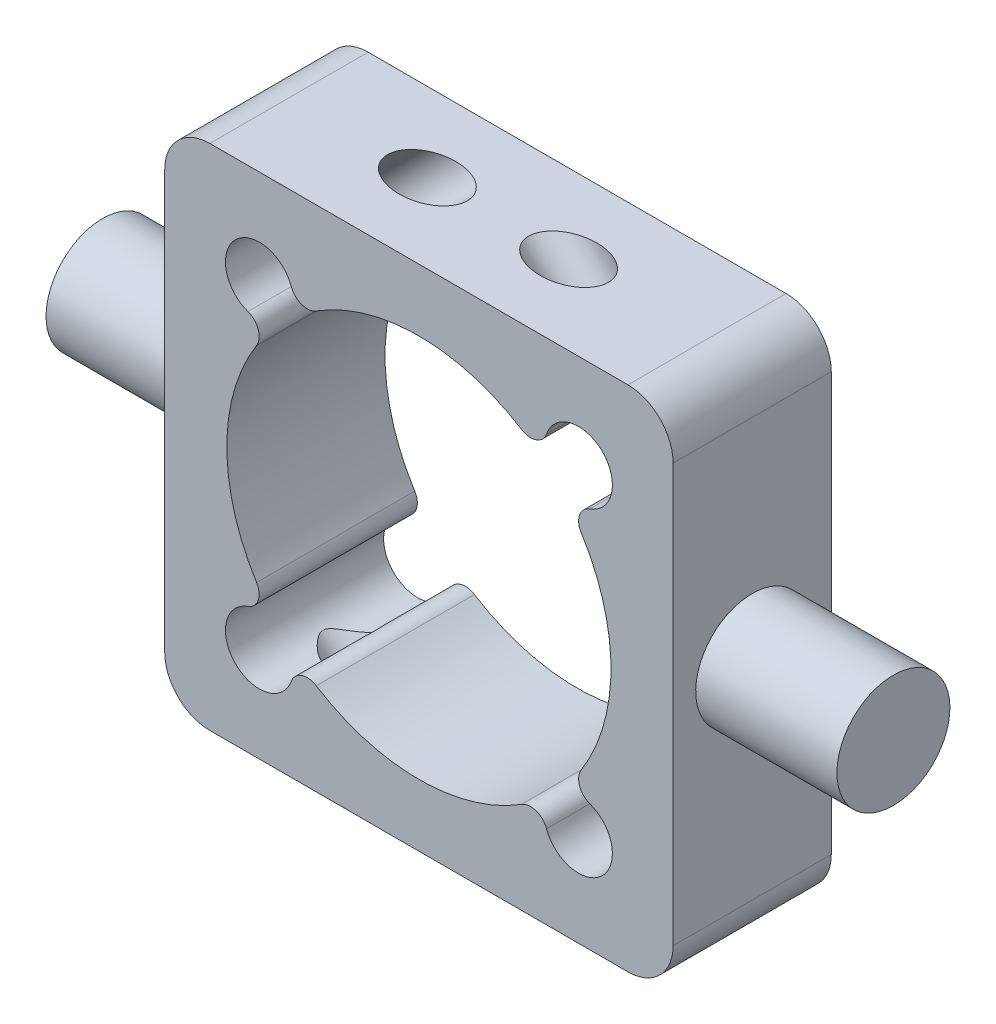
ISO-10303-21;
HEADER;
FILE_DESCRIPTION(('STEP AP214'),'2;1');
FILE_NAME('part.step','',(''),(''),'','','');
FILE_SCHEMA(('AUTOMOTIVE_DESIGN { 1 0 10303 214 1 1 1 1 }'));
ENDSEC;
DATA;
#1=APPLICATION_CONTEXT('core data for automotive mechanical design processes');
#2=APPLICATION_PROTOCOL_DEFINITION('international standard','automotive_design',2000,#1);
#3=PRODUCT_CONTEXT('',#1,'mechanical');
#4=PRODUCT('Part','Part','',(#3));
#5=PRODUCT_RELATED_PRODUCT_CATEGORY('part','',(#4));
#6=PRODUCT_DEFINITION_FORMATION('','',#4);
#7=PRODUCT_DEFINITION_CONTEXT('part definition',#1,'design');
#8=PRODUCT_DEFINITION('design','',#6,#7);
#9=PRODUCT_DEFINITION_SHAPE('','',#8);
#10=(LENGTH_UNIT() NAMED_UNIT(*) SI_UNIT(.MILLI.,.METRE.));
#11=(NAMED_UNIT(*) PLANE_ANGLE_UNIT() SI_UNIT($,.RADIAN.));
#12=(NAMED_UNIT(*) SI_UNIT($,.STERADIAN.) SOLID_ANGLE_UNIT());
#13=UNCERTAINTY_MEASURE_WITH_UNIT(LENGTH_MEASURE(1.E-05),#10,'distance_accuracy_value','');
#14=(GEOMETRIC_REPRESENTATION_CONTEXT(3) GLOBAL_UNCERTAINTY_ASSIGNED_CONTEXT((#13)) GLOBAL_UNIT_ASSIGNED_CONTEXT((#10,
#11,#12)) REPRESENTATION_CONTEXT('',''));
#15=CARTESIAN_POINT('',(0.,0.,0.));
#16=DIRECTION('',(0.,0.,1.));
#17=DIRECTION('',(1.,0.,0.));
#18=AXIS2_PLACEMENT_3D('',#15,#16,#17);
#19=CARTESIAN_POINT('',(-45.,-45.,28.));
#20=DIRECTION('',(0.,1.,0.));
#21=DIRECTION('',(-1.,0.,0.));
#22=AXIS2_PLACEMENT_3D('',#19,#20,#21);
#23=PLANE('',#22);
#24=DIRECTION('',(1.,0.,0.));
#25=VECTOR('',#24,1.);
#26=CARTESIAN_POINT('',(-45.,-45.,0.));
#27=LINE('',#26,#25);
#28=CARTESIAN_POINT('',(-37.,-45.,0.));
#29=VERTEX_POINT('',#28);
#30=CARTESIAN_POINT('',(37.,-45.,0.));
#31=VERTEX_POINT('',#30);
#32=EDGE_CURVE('E270',#29,#31,#27,.T.);
#33=ORIENTED_EDGE('',*,*,#32,.T.);
#34=DIRECTION('',(0.,0.,-1.));
#35=VECTOR('',#34,1.);
#36=CARTESIAN_POINT('',(37.,-45.,28.));
#37=LINE('',#36,#35);
#38=CARTESIAN_POINT('',(37.,-45.,28.));
#39=VERTEX_POINT('',#38);
#40=EDGE_CURVE('E309',#31,#39,#37,.F.);
#41=ORIENTED_EDGE('',*,*,#40,.T.);
#42=DIRECTION('',(1.,0.,0.));
#43=VECTOR('',#42,1.);
#44=CARTESIAN_POINT('',(-45.,-45.,28.));
#45=LINE('',#44,#43);
#46=CARTESIAN_POINT('',(-37.,-45.,28.));
#47=VERTEX_POINT('',#46);
#48=EDGE_CURVE('E257',#47,#39,#45,.T.);
#49=ORIENTED_EDGE('',*,*,#48,.F.);
#50=DIRECTION('',(0.,0.,-1.));
#51=VECTOR('',#50,1.);
#52=CARTESIAN_POINT('',(-37.,-45.,28.));
#53=LINE('',#52,#51);
#54=EDGE_CURVE('E306',#47,#29,#53,.T.);
#55=ORIENTED_EDGE('',*,*,#54,.T.);
#56=EDGE_LOOP('',(#33,#41,#49,#55));
#57=FACE_BOUND('',#56,.T.);
#58=CARTESIAN_POINT('',(12.4974746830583,-45.,14.));
#59=DIRECTION('',(0.,1.,0.));
#60=DIRECTION('',(-1.,0.,0.));
#61=AXIS2_PLACEMENT_3D('',#58,#59,#60);
#62=ELLIPSE('',#61,7.07106781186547,5.00000000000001);
#63=CARTESIAN_POINT('',(5.42640687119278,-45.,14.));
#64=VERTEX_POINT('',#63);
#65=EDGE_CURVE('E398',#64,#64,#62,.T.);
#66=ORIENTED_EDGE('',*,*,#65,.T.);
#67=EDGE_LOOP('',(#66));
#68=FACE_BOUND('',#67,.T.);
#69=CARTESIAN_POINT('',(-12.4974746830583,-45.,14.));
#70=DIRECTION('',(0.,1.,0.));
#71=DIRECTION('',(1.,0.,0.));
#72=AXIS2_PLACEMENT_3D('',#69,#70,#71);
#73=ELLIPSE('',#72,7.07106781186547,5.00000000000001);
#74=CARTESIAN_POINT('',(-5.42640687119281,-45.,14.));
#75=VERTEX_POINT('',#74);
#76=EDGE_CURVE('E229',#75,#75,#73,.F.);
#77=ORIENTED_EDGE('',*,*,#76,.F.);
#78=EDGE_LOOP('',(#77));
#79=FACE_BOUND('',#78,.T.);
#80=ADVANCED_FACE('F31',(#57,#68,#79),#23,.F.);
#81=CARTESIAN_POINT('',(-28.25,-28.25,28.));
#82=DIRECTION('',(0.,0.,-1.));
#83=DIRECTION('',(-1.,0.,0.));
#84=AXIS2_PLACEMENT_3D('',#81,#82,#83);
#85=CYLINDRICAL_SURFACE('',#84,6.);
#86=DIRECTION('',(0.,0.,-1.));
#87=VECTOR('',#86,1.);
#88=CARTESIAN_POINT('',(-22.5986910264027,-30.2656157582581,28.));
#89=LINE('',#88,#87);
#90=CARTESIAN_POINT('',(-22.5986910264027,-30.2656157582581,28.));
#91=VERTEX_POINT('',#90);
#92=CARTESIAN_POINT('',(-22.5986910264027,-30.2656157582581,17.7771520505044));
#93=VERTEX_POINT('',#92);
#94=EDGE_CURVE('E228',#91,#93,#89,.T.);
#95=ORIENTED_EDGE('',*,*,#94,.T.);
#96=CARTESIAN_POINT('',(-22.5986910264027,-30.2656157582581,17.7771520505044));
#97=CARTESIAN_POINT('',(-22.6322695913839,-30.3597833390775,17.8555008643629));
#98=CARTESIAN_POINT('',(-22.6689987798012,-30.4553036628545,17.9309324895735));
#99=CARTESIAN_POINT('',(-22.749205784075,-30.6483698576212,18.0755356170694));
#100=CARTESIAN_POINT('',(-22.7926895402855,-30.745917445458,18.1447015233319));
#101=CARTESIAN_POINT('',(-22.8871279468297,-30.9428830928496,18.2766722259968));
#102=CARTESIAN_POINT('',(-22.9381332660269,-31.042309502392,18.3394285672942));
#103=CARTESIAN_POINT('',(-23.0476784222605,-31.2414474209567,18.4574246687));
#104=CARTESIAN_POINT('',(-23.1062163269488,-31.34115885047,18.5126663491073));
#105=CARTESIAN_POINT('',(-23.231393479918,-31.5405200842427,18.6153604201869));
#106=CARTESIAN_POINT('',(-23.2980792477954,-31.6401659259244,18.6627640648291));
#107=CARTESIAN_POINT('',(-23.4392674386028,-31.8376990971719,18.7487742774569));
#108=CARTESIAN_POINT('',(-23.5137687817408,-31.9355866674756,18.7873820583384));
#109=CARTESIAN_POINT('',(-23.6701161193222,-32.1281425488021,18.8551663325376));
#110=CARTESIAN_POINT('',(-23.75193598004,-32.2228207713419,18.8843747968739));
#111=CARTESIAN_POINT('',(-23.9226899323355,-32.4081553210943,18.9331455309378));
#112=CARTESIAN_POINT('',(-24.0116229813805,-32.4988122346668,18.9527092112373));
#113=CARTESIAN_POINT('',(-24.1858180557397,-32.6653500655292,18.9803812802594));
#114=CARTESIAN_POINT('',(-24.2704134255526,-32.7417612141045,18.9895104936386));
#115=CARTESIAN_POINT('',(-24.4441389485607,-32.8898763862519,18.9999617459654));
#116=CARTESIAN_POINT('',(-24.5332705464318,-32.961578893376,19.0012812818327));
#117=CARTESIAN_POINT('',(-24.7153832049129,-33.0996959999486,18.9962381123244));
#118=CARTESIAN_POINT('',(-24.8083658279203,-33.1661084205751,18.9898722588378));
#119=CARTESIAN_POINT('',(-24.9974403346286,-33.2931972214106,18.9697132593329));
#120=CARTESIAN_POINT('',(-25.0935334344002,-33.3538713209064,18.9559171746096));
#121=CARTESIAN_POINT('',(-25.2840655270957,-33.4667985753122,18.9219729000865));
#122=CARTESIAN_POINT('',(-25.3784113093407,-33.519294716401,18.9021077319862));
#123=CARTESIAN_POINT('',(-25.5686168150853,-33.6185858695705,18.8562771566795));
#124=CARTESIAN_POINT('',(-25.6644770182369,-33.665379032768,18.8303097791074));
#125=CARTESIAN_POINT('',(-25.953371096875,-33.7970877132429,18.7438983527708));
#126=CARTESIAN_POINT('',(-26.1478801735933,-33.8734273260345,18.6749151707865));
#127=CARTESIAN_POINT('',(-26.4800957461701,-33.9848681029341,18.5406134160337));
#128=CARTESIAN_POINT('',(-26.6179563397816,-34.0255103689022,18.4800078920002));
#129=CARTESIAN_POINT('',(-26.8924605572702,-34.096124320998,18.3503056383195));
#130=CARTESIAN_POINT('',(-27.0291036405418,-34.1260914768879,18.2812053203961));
#131=CARTESIAN_POINT('',(-27.4363951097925,-34.2009915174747,18.0624634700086));
#132=CARTESIAN_POINT('',(-27.7039447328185,-34.2307742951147,17.9015720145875));
#133=CARTESIAN_POINT('',(-28.139157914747,-34.2515353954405,17.6136402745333));
#134=CARTESIAN_POINT('',(-28.3107517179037,-34.2520497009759,17.4928519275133));
#135=CARTESIAN_POINT('',(-28.646711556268,-34.2392274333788,17.2420665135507));
#136=CARTESIAN_POINT('',(-28.8110739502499,-34.2258839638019,17.1120648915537));
#137=CARTESIAN_POINT('',(-29.1310436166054,-34.1871465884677,16.8438516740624));
#138=CARTESIAN_POINT('',(-29.2866618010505,-34.1617680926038,16.7056507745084));
#139=CARTESIAN_POINT('',(-29.5878857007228,-34.1009494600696,16.4209548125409));
#140=CARTESIAN_POINT('',(-29.7334971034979,-34.0655150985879,16.2744645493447));
#141=CARTESIAN_POINT('',(-29.994040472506,-33.9923118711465,15.9920472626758));
#142=CARTESIAN_POINT('',(-30.1104857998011,-33.9554673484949,15.8572754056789));
#143=CARTESIAN_POINT('',(-30.3314806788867,-33.8785919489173,15.5787840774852));
#144=CARTESIAN_POINT('',(-30.436021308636,-33.8385587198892,15.4350580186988));
#145=CARTESIAN_POINT('',(-30.6085932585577,-33.7676054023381,15.1649557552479));
#146=CARTESIAN_POINT('',(-30.6797662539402,-33.7364342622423,15.0406837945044));
#147=CARTESIAN_POINT('',(-30.8043642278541,-33.6795376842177,14.7823247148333));
#148=CARTESIAN_POINT('',(-30.8578562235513,-33.6537918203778,14.6482770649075));
#149=CARTESIAN_POINT('',(-30.9227755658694,-33.6218813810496,14.4202259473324));
#150=CARTESIAN_POINT('',(-30.9424132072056,-33.6120043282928,14.3291725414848));
#151=CARTESIAN_POINT('',(-30.9673817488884,-33.599397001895,14.1447200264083));
#152=CARTESIAN_POINT('',(-30.9727457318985,-33.596650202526,14.0513268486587));
#153=CARTESIAN_POINT('',(-30.9682641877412,-33.5989288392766,13.8649186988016));
#154=CARTESIAN_POINT('',(-30.9584008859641,-33.6039633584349,13.7719042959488));
#155=CARTESIAN_POINT('',(-30.92514137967,-33.6206565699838,13.5888680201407));
#156=CARTESIAN_POINT('',(-30.9017119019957,-33.6323315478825,13.4988540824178));
#157=CARTESIAN_POINT('',(-30.8249019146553,-33.6696546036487,13.2634125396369));
#158=CARTESIAN_POINT('',(-30.7619866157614,-33.6994077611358,13.1218595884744));
#159=CARTESIAN_POINT('',(-30.6180989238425,-33.7634735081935,12.8492965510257));
#160=CARTESIAN_POINT('',(-30.5370462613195,-33.7978060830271,12.7183369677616));
#161=CARTESIAN_POINT('',(-30.3495610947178,-33.8717010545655,12.4447963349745));
#162=CARTESIAN_POINT('',(-30.2411418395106,-33.9112441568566,12.3035873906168));
#163=CARTESIAN_POINT('',(-30.0131059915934,-33.9863706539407,12.0292861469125));
#164=CARTESIAN_POINT('',(-29.8934776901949,-34.0219498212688,11.8962025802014));
#165=CARTESIAN_POINT('',(-29.6452652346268,-34.0869278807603,11.6367004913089));
#166=CARTESIAN_POINT('',(-29.5166686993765,-34.1163179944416,11.5102916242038));
#167=CARTESIAN_POINT('',(-29.2521167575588,-34.167255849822,11.2638655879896));
#168=CARTESIAN_POINT('',(-29.1161642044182,-34.1888066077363,11.143845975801));
#169=CARTESIAN_POINT('',(-28.8196910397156,-34.2249942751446,10.8949734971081));
#170=CARTESIAN_POINT('',(-28.6582731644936,-34.2383693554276,10.7669985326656));
#171=CARTESIAN_POINT('',(-28.3282223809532,-34.2517650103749,10.5197916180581));
#172=CARTESIAN_POINT('',(-28.1595869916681,-34.2517809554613,10.4005627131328));
#173=CARTESIAN_POINT('',(-27.816781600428,-34.2367890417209,10.1724828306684));
#174=CARTESIAN_POINT('',(-27.642631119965,-34.2218294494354,10.0635997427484));
#175=CARTESIAN_POINT('',(-27.2897123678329,-34.1753321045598,9.85756427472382));
#176=CARTESIAN_POINT('',(-27.110945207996,-34.1437983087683,9.76040910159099));
#177=CARTESIAN_POINT('',(-26.7044795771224,-34.0521494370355,9.55702501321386));
#178=CARTESIAN_POINT('',(-26.4758756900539,-33.9868122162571,9.45474961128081));
#179=CARTESIAN_POINT('',(-26.1334226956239,-33.8655876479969,9.32184788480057));
#180=CARTESIAN_POINT('',(-26.0193169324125,-33.8212948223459,9.28095774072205));
#181=CARTESIAN_POINT('',(-25.7920188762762,-33.724809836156,9.2067167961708));
#182=CARTESIAN_POINT('',(-25.6788261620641,-33.6726215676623,9.17336230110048));
#183=CARTESIAN_POINT('',(-25.4531516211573,-33.5597751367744,9.11460966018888));
#184=CARTESIAN_POINT('',(-25.340687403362,-33.4990395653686,9.089292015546));
#185=CARTESIAN_POINT('',(-25.1186968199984,-33.3697096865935,9.04774058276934));
#186=CARTESIAN_POINT('',(-25.0091689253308,-33.3011195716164,9.03150197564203));
#187=CARTESIAN_POINT('',(-24.7941487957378,-33.1565130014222,9.00864758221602));
#188=CARTESIAN_POINT('',(-24.6886546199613,-33.0805001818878,9.00202710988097));
#189=CARTESIAN_POINT('',(-24.4827463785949,-32.9216909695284,8.99877075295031));
#190=CARTESIAN_POINT('',(-24.382331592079,-32.838895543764,9.00213344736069));
#191=CARTESIAN_POINT('',(-24.2005243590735,-32.678816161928,9.01786978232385));
#192=CARTESIAN_POINT('',(-24.1183770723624,-32.6022613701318,9.02898691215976));
#193=CARTESIAN_POINT('',(-23.9591647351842,-32.4453814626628,9.0587989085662));
#194=CARTESIAN_POINT('',(-23.8821013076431,-32.365055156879,9.07749618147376));
#195=CARTESIAN_POINT('',(-23.7335402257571,-32.2014294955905,9.12229908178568));
#196=CARTESIAN_POINT('',(-23.6620408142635,-32.1181310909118,9.14840235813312));
#197=CARTESIAN_POINT('',(-23.5248526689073,-31.9493022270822,9.20774615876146));
#198=CARTESIAN_POINT('',(-23.4591661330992,-31.8637709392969,9.24098936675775));
#199=CARTESIAN_POINT('',(-23.2735221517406,-31.6083176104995,9.34951989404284));
#200=CARTESIAN_POINT('',(-23.162032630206,-31.4362408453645,9.43452313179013));
#201=CARTESIAN_POINT('',(-22.9619846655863,-31.0919415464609,9.62764920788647));
#202=CARTESIAN_POINT('',(-22.8734290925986,-30.919718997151,9.7357749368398));
#203=CARTESIAN_POINT('',(-22.7578982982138,-30.6676429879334,9.91097510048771));
#204=CARTESIAN_POINT('',(-22.7227473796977,-30.5860433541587,9.9703925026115));
#205=CARTESIAN_POINT('',(-22.6572380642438,-30.4245304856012,10.0934726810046));
#206=CARTESIAN_POINT('',(-22.6268664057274,-30.3446131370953,10.1571229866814));
#207=CARTESIAN_POINT('',(-22.5986910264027,-30.2656157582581,10.2228479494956));
#208=B_SPLINE_CURVE_WITH_KNOTS('',3,(#96,#97,#98,#99,#100,#101,#102,#103,#104,#105,#106,#107,
#108,#109,#110,#111,#112,#113,#114,#115,#116,#117,#118,#119,#120,#121,#122,#123,#124,#125,#126,
#127,#128,#129,#130,#131,#132,#133,#134,#135,#136,#137,#138,#139,#140,#141,#142,#143,#144,#145,
#146,#147,#148,#149,#150,#151,#152,#153,#154,#155,#156,#157,#158,#159,#160,#161,#162,#163,#164,
#165,#166,#167,#168,#169,#170,#171,#172,#173,#174,#175,#176,#177,#178,#179,#180,#181,#182,#183,
#184,#185,#186,#187,#188,#189,#190,#191,#192,#193,#194,#195,#196,#197,#198,#199,#200,#201,#202,
#203,#204,#205,#206,#207),.UNSPECIFIED.,.F.,.F.,(4,2,2,2,2,2,2,2,2,2,2,2,2,2,2,2,2,2,2,2,2,2,2,
2,2,2,2,2,2,2,2,2,2,2,2,2,2,2,2,2,2,2,2,2,2,2,2,2,2,2,2,2,2,2,2,4),(0.,0.381029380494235,
0.762395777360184,1.14645972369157,1.53042534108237,1.91669573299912,2.30291282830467,
2.6878020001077,3.07263486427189,3.41527249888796,3.75801994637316,4.10090783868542,
4.4439314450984,4.77291885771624,5.10201264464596,5.75963628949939,6.22701471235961,
6.69459124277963,7.63128686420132,8.26014911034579,8.88932446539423,9.51769637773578,
10.1457081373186,10.6908878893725,11.2364735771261,11.6753566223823,12.1125565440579,
12.392415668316,12.671625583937,12.9511616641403,13.2313862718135,13.7018851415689,
14.1745089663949,14.720830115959,15.2677284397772,15.8153973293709,16.3628552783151,
16.9814311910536,17.6002214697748,18.2170237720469,18.8336788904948,19.6068139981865,
19.993587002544,20.3801699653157,20.7705111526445,21.1606449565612,21.5505886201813,
21.9404767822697,22.2785660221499,22.6167626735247,22.9548520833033,23.2930687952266,
23.9561207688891,24.6192556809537,24.9397398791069,25.259318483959),.UNSPECIFIED.);
#209=CARTESIAN_POINT('',(-22.5986910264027,-30.2656157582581,10.2228479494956));
#210=VERTEX_POINT('',#209);
#211=EDGE_CURVE('E50',#93,#210,#208,.T.);
#212=ORIENTED_EDGE('',*,*,#211,.T.);
#213=CARTESIAN_POINT('',(-22.5986910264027,-30.2656157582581,0.));
#214=VERTEX_POINT('',#213);
#215=EDGE_CURVE('E226',#210,#214,#89,.T.);
#216=ORIENTED_EDGE('',*,*,#215,.T.);
#217=CARTESIAN_POINT('',(-28.25,-28.25,0.));
#218=DIRECTION('',(0.,0.,1.));
#219=DIRECTION('',(1.,0.,0.));
#220=AXIS2_PLACEMENT_3D('',#217,#218,#219);
#221=CIRCLE('',#220,6.);
#222=CARTESIAN_POINT('',(-30.2656157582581,-22.5986910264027,0.));
#223=VERTEX_POINT('',#222);
#224=EDGE_CURVE('E506',#223,#214,#221,.T.);
#225=ORIENTED_EDGE('',*,*,#224,.F.);
#226=DIRECTION('',(0.,0.,-1.));
#227=VECTOR('',#226,1.);
#228=CARTESIAN_POINT('',(-30.2656157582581,-22.5986910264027,28.));
#229=LINE('',#228,#227);
#230=CARTESIAN_POINT('',(-30.2656157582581,-22.5986910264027,28.));
#231=VERTEX_POINT('',#230);
#232=EDGE_CURVE('E237',#231,#223,#229,.T.);
#233=ORIENTED_EDGE('',*,*,#232,.F.);
#234=CARTESIAN_POINT('',(-28.25,-28.25,28.));
#235=DIRECTION('',(0.,0.,1.));
#236=DIRECTION('',(1.,0.,0.));
#237=AXIS2_PLACEMENT_3D('',#234,#235,#236);
#238=CIRCLE('',#237,6.);
#239=EDGE_CURVE('E568',#231,#91,#238,.T.);
#240=ORIENTED_EDGE('',*,*,#239,.T.);
#241=EDGE_LOOP('',(#95,#212,#216,#225,#233,#240));
#242=FACE_BOUND('',#241,.T.);
#243=ADVANCED_FACE('F224',(#242),#85,.F.);
#244=CARTESIAN_POINT('',(-19.773036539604,-31.2734236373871,28.));
#245=DIRECTION('',(0.,0.,-1.));
#246=DIRECTION('',(-1.,0.,0.));
#247=AXIS2_PLACEMENT_3D('',#244,#245,#246);
#248=CYLINDRICAL_SURFACE('',#247,3.);
#249=ORIENTED_EDGE('',*,*,#215,.F.);
#250=CARTESIAN_POINT('',(-22.5986910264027,-30.2656157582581,10.2228479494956));
#251=CARTESIAN_POINT('',(-22.5708890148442,-30.1876586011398,10.2876617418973));
#252=CARTESIAN_POINT('',(-22.5407373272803,-30.1133172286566,10.3556857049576));
#253=CARTESIAN_POINT('',(-22.4771945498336,-29.9720749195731,10.4974356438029));
#254=CARTESIAN_POINT('',(-22.4438093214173,-29.9051609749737,10.5711512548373));
#255=CARTESIAN_POINT('',(-22.3754341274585,-29.7792267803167,10.723170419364));
#256=CARTESIAN_POINT('',(-22.3404597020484,-29.7201458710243,10.8014310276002));
#257=CARTESIAN_POINT('',(-22.269841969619,-29.6090021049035,10.962547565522));
#258=CARTESIAN_POINT('',(-22.2341983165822,-29.5569429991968,11.0454059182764));
#259=CARTESIAN_POINT('',(-22.1547246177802,-29.4477268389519,11.2357747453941));
#260=CARTESIAN_POINT('',(-22.1110086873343,-29.3924021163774,11.344385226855));
#261=CARTESIAN_POINT('',(-22.0260084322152,-29.2913851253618,11.5668922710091));
#262=CARTESIAN_POINT('',(-21.9847244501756,-29.2456942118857,11.6807895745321));
#263=CARTESIAN_POINT('',(-21.9059582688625,-29.1629931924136,11.9134035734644));
#264=CARTESIAN_POINT('',(-21.868488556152,-29.1260111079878,12.0321344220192));
#265=CARTESIAN_POINT('',(-21.798773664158,-29.0601252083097,12.2732991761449));
#266=CARTESIAN_POINT('',(-21.7665282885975,-29.0312210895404,12.3957329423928));
#267=CARTESIAN_POINT('',(-21.7078984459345,-28.9804263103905,12.6453570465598));
#268=CARTESIAN_POINT('',(-21.6816048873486,-28.9586424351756,12.7725904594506));
#269=CARTESIAN_POINT('',(-21.6363626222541,-28.9220702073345,13.0293472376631));
#270=CARTESIAN_POINT('',(-21.6174138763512,-28.9072818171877,13.1588705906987));
#271=CARTESIAN_POINT('',(-21.5875219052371,-28.8842816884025,13.4192652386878));
#272=CARTESIAN_POINT('',(-21.5765694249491,-28.8760623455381,13.550134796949));
#273=CARTESIAN_POINT('',(-21.5630101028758,-28.8659216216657,13.812550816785));
#274=CARTESIAN_POINT('',(-21.5604034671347,-28.864000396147,13.9440972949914));
#275=CARTESIAN_POINT('',(-21.5637337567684,-28.8664729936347,14.2155331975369));
#276=CARTESIAN_POINT('',(-21.5702336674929,-28.8712829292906,14.3554124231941));
#277=CARTESIAN_POINT('',(-21.592547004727,-28.8881405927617,14.6339922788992));
#278=CARTESIAN_POINT('',(-21.6083610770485,-28.9001888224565,14.7726928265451));
#279=CARTESIAN_POINT('',(-21.6487300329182,-28.9319638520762,15.0482070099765));
#280=CARTESIAN_POINT('',(-21.6733020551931,-28.951705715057,15.1850163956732));
#281=CARTESIAN_POINT('',(-21.7302406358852,-28.9994992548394,15.4555230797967));
#282=CARTESIAN_POINT('',(-21.7626069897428,-29.0275507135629,15.589220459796));
#283=CARTESIAN_POINT('',(-21.8341056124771,-29.0929753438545,15.8533367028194));
#284=CARTESIAN_POINT('',(-21.873275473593,-29.1304008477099,15.9837324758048));
#285=CARTESIAN_POINT('',(-21.95671495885,-29.2154879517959,16.2395033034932));
#286=CARTESIAN_POINT('',(-22.0009855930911,-29.2631515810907,16.3648773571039));
#287=CARTESIAN_POINT('',(-22.0925401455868,-29.3695323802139,16.6089555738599));
#288=CARTESIAN_POINT('',(-22.1398090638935,-29.4281970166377,16.7276880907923));
#289=CARTESIAN_POINT('',(-22.2352849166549,-29.5576732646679,16.9578369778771));
#290=CARTESIAN_POINT('',(-22.2834911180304,-29.6284756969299,17.0692587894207));
#291=CARTESIAN_POINT('',(-22.3794572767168,-29.7850679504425,17.2863415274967));
#292=CARTESIAN_POINT('',(-22.4271741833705,-29.87119518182,17.3917818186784));
#293=CARTESIAN_POINT('',(-22.494973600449,-30.010982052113,17.5422209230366));
#294=CARTESIAN_POINT('',(-22.516995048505,-30.0594801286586,17.5911946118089));
#295=CARTESIAN_POINT('',(-22.5592822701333,-30.1599563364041,17.6863334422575));
#296=CARTESIAN_POINT('',(-22.5795465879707,-30.2119372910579,17.7324962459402));
#297=CARTESIAN_POINT('',(-22.5986910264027,-30.2656157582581,17.7771520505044));
#298=B_SPLINE_CURVE_WITH_KNOTS('',3,(#250,#251,#252,#253,#254,#255,#256,#257,#258,#259,#260,
#261,#262,#263,#264,#265,#266,#267,#268,#269,#270,#271,#272,#273,#274,#275,#276,#277,#278,#279,
#280,#281,#282,#283,#284,#285,#286,#287,#288,#289,#290,#291,#292,#293,#294,#295,#296,#297),
.UNSPECIFIED.,.F.,.F.,(4,2,2,2,2,2,2,2,2,2,2,2,2,2,2,2,2,2,2,2,2,2,2,4),(0.,0.315121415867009,
0.629681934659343,0.94164313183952,1.25377032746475,1.64169953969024,2.02968327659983,
2.41889883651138,2.80809977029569,3.20289516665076,3.59768844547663,3.99202405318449,
4.38636939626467,4.80619803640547,5.22605578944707,5.64673972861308,6.06741262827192,
6.49048850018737,6.91364829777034,7.33483658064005,7.75570772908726,8.18735814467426,
8.40428549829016,8.62139088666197),.UNSPECIFIED.);
#299=EDGE_CURVE('E11',#210,#93,#298,.T.);
#300=ORIENTED_EDGE('',*,*,#299,.T.);
#301=ORIENTED_EDGE('',*,*,#94,.F.);
#302=CARTESIAN_POINT('',(-19.773036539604,-31.2734236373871,28.));
#303=DIRECTION('',(0.,0.,-1.));
#304=DIRECTION('',(1.,0.,0.));
#305=AXIS2_PLACEMENT_3D('',#302,#303,#304);
#306=CIRCLE('',#305,3.);
#307=CARTESIAN_POINT('',(-18.1698173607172,-28.7377406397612,28.));
#308=VERTEX_POINT('',#307);
#309=EDGE_CURVE('E575',#91,#308,#306,.T.);
#310=ORIENTED_EDGE('',*,*,#309,.T.);
#311=DIRECTION('',(0.,0.,-1.));
#312=VECTOR('',#311,1.);
#313=CARTESIAN_POINT('',(-18.1698173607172,-28.7377406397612,28.));
#314=LINE('',#313,#312);
#315=CARTESIAN_POINT('',(-18.1698173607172,-28.7377406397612,0.));
#316=VERTEX_POINT('',#315);
#317=EDGE_CURVE('E235',#308,#316,#314,.T.);
#318=ORIENTED_EDGE('',*,*,#317,.T.);
#319=CARTESIAN_POINT('',(-19.773036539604,-31.2734236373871,0.));
#320=DIRECTION('',(0.,0.,-1.));
#321=DIRECTION('',(1.,0.,0.));
#322=AXIS2_PLACEMENT_3D('',#319,#320,#321);
#323=CIRCLE('',#322,3.);
#324=EDGE_CURVE('E233',#214,#316,#323,.T.);
#325=ORIENTED_EDGE('',*,*,#324,.F.);
#326=EDGE_LOOP('',(#249,#300,#301,#310,#318,#325));
#327=FACE_BOUND('',#326,.T.);
#328=ADVANCED_FACE('F231',(#327),#248,.T.);
#329=CARTESIAN_POINT('',(-45.,45.,28.));
#330=DIRECTION('',(0.,-1.,0.));
#331=DIRECTION('',(1.,0.,0.));
#332=AXIS2_PLACEMENT_3D('',#329,#330,#331);
#333=PLANE('',#332);
#334=CARTESIAN_POINT('',(-12.4974746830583,45.,14.));
#335=DIRECTION('',(0.,-1.,0.));
#336=DIRECTION('',(1.,0.,0.));
#337=AXIS2_PLACEMENT_3D('',#334,#335,#336);
#338=ELLIPSE('',#337,7.07106781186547,5.00000000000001);
#339=CARTESIAN_POINT('',(-5.42640687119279,45.,14.));
#340=VERTEX_POINT('',#339);
#341=EDGE_CURVE('E354',#340,#340,#338,.T.);
#342=ORIENTED_EDGE('',*,*,#341,.T.);
#343=EDGE_LOOP('',(#342));
#344=FACE_BOUND('',#343,.T.);
#345=DIRECTION('',(-1.,0.,0.));
#346=VECTOR('',#345,1.);
#347=CARTESIAN_POINT('',(-45.,45.,28.));
#348=LINE('',#347,#346);
#349=CARTESIAN_POINT('',(37.,45.,28.));
#350=VERTEX_POINT('',#349);
#351=CARTESIAN_POINT('',(-37.,45.,28.));
#352=VERTEX_POINT('',#351);
#353=EDGE_CURVE('E264',#350,#352,#348,.T.);
#354=ORIENTED_EDGE('',*,*,#353,.F.);
#355=DIRECTION('',(0.,0.,-1.));
#356=VECTOR('',#355,1.);
#357=CARTESIAN_POINT('',(37.,45.,28.));
#358=LINE('',#357,#356);
#359=CARTESIAN_POINT('',(37.,45.,0.));
#360=VERTEX_POINT('',#359);
#361=EDGE_CURVE('E282',#350,#360,#358,.T.);
#362=ORIENTED_EDGE('',*,*,#361,.T.);
#363=DIRECTION('',(-1.,0.,0.));
#364=VECTOR('',#363,1.);
#365=CARTESIAN_POINT('',(-45.,45.,0.));
#366=LINE('',#365,#364);
#367=CARTESIAN_POINT('',(-37.,45.,0.));
#368=VERTEX_POINT('',#367);
#369=EDGE_CURVE('E258',#360,#368,#366,.T.);
#370=ORIENTED_EDGE('',*,*,#369,.T.);
#371=DIRECTION('',(0.,0.,-1.));
#372=VECTOR('',#371,1.);
#373=CARTESIAN_POINT('',(-37.,45.,28.));
#374=LINE('',#373,#372);
#375=EDGE_CURVE('E280',#368,#352,#374,.F.);
#376=ORIENTED_EDGE('',*,*,#375,.T.);
#377=EDGE_LOOP('',(#354,#362,#370,#376));
#378=FACE_BOUND('',#377,.T.);
#379=CARTESIAN_POINT('',(12.4974746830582,45.,14.));
#380=DIRECTION('',(0.,-1.,0.));
#381=DIRECTION('',(-1.,0.,0.));
#382=AXIS2_PLACEMENT_3D('',#379,#380,#381);
#383=ELLIPSE('',#382,7.07106781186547,5.00000000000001);
#384=CARTESIAN_POINT('',(5.42640687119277,45.,14.));
#385=VERTEX_POINT('',#384);
#386=EDGE_CURVE('E353',#385,#385,#383,.F.);
#387=ORIENTED_EDGE('',*,*,#386,.F.);
#388=EDGE_LOOP('',(#387));
#389=FACE_BOUND('',#388,.T.);
#390=ADVANCED_FACE('F361',(#344,#378,#389),#333,.F.);
#391=CARTESIAN_POINT('',(28.25,28.25,28.));
#392=DIRECTION('',(0.,0.,-1.));
#393=DIRECTION('',(-1.,0.,0.));
#394=AXIS2_PLACEMENT_3D('',#391,#392,#393);
#395=CYLINDRICAL_SURFACE('',#394,6.);
#396=DIRECTION('',(0.,0.,-1.));
#397=VECTOR('',#396,1.);
#398=CARTESIAN_POINT('',(22.5986910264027,30.2656157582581,28.));
#399=LINE('',#398,#397);
#400=CARTESIAN_POINT('',(22.5986910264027,30.2656157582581,28.));
#401=VERTEX_POINT('',#400);
#402=CARTESIAN_POINT('',(22.5986910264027,30.2656157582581,17.7771520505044));
#403=VERTEX_POINT('',#402);
#404=EDGE_CURVE('E539',#401,#403,#399,.T.);
#405=ORIENTED_EDGE('',*,*,#404,.T.);
#406=CARTESIAN_POINT('',(22.5986910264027,30.2656157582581,17.7771520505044));
#407=CARTESIAN_POINT('',(22.6322695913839,30.3597833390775,17.8555008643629));
#408=CARTESIAN_POINT('',(22.6689987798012,30.4553036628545,17.9309324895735));
#409=CARTESIAN_POINT('',(22.749205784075,30.6483698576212,18.0755356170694));
#410=CARTESIAN_POINT('',(22.7926895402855,30.745917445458,18.1447015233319));
#411=CARTESIAN_POINT('',(22.8871279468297,30.9428830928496,18.2766722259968));
#412=CARTESIAN_POINT('',(22.9381332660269,31.042309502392,18.3394285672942));
#413=CARTESIAN_POINT('',(23.0476784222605,31.2414474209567,18.4574246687));
#414=CARTESIAN_POINT('',(23.1062163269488,31.34115885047,18.5126663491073));
#415=CARTESIAN_POINT('',(23.231393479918,31.5405200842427,18.6153604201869));
#416=CARTESIAN_POINT('',(23.2980792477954,31.6401659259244,18.6627640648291));
#417=CARTESIAN_POINT('',(23.4392674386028,31.8376990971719,18.7487742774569));
#418=CARTESIAN_POINT('',(23.5137687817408,31.9355866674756,18.7873820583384));
#419=CARTESIAN_POINT('',(23.6701161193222,32.1281425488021,18.8551663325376));
#420=CARTESIAN_POINT('',(23.75193598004,32.2228207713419,18.8843747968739));
#421=CARTESIAN_POINT('',(23.9226899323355,32.4081553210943,18.9331455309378));
#422=CARTESIAN_POINT('',(24.0116229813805,32.4988122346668,18.9527092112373));
#423=CARTESIAN_POINT('',(24.1858180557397,32.6653500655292,18.9803812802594));
#424=CARTESIAN_POINT('',(24.2704134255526,32.7417612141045,18.9895104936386));
#425=CARTESIAN_POINT('',(24.4441389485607,32.8898763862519,18.9999617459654));
#426=CARTESIAN_POINT('',(24.5332705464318,32.961578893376,19.0012812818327));
#427=CARTESIAN_POINT('',(24.7153832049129,33.0996959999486,18.9962381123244));
#428=CARTESIAN_POINT('',(24.8083658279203,33.1661084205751,18.9898722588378));
#429=CARTESIAN_POINT('',(24.9974403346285,33.2931972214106,18.9697132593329));
#430=CARTESIAN_POINT('',(25.0935334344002,33.3538713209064,18.9559171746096));
#431=CARTESIAN_POINT('',(25.2840655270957,33.4667985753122,18.9219729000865));
#432=CARTESIAN_POINT('',(25.3784113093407,33.519294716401,18.9021077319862));
#433=CARTESIAN_POINT('',(25.5686168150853,33.6185858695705,18.8562771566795));
#434=CARTESIAN_POINT('',(25.6644770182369,33.665379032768,18.8303097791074));
#435=CARTESIAN_POINT('',(25.953371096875,33.7970877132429,18.7438983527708));
#436=CARTESIAN_POINT('',(26.1478801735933,33.8734273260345,18.6749151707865));
#437=CARTESIAN_POINT('',(26.4800957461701,33.9848681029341,18.5406134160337));
#438=CARTESIAN_POINT('',(26.6179563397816,34.0255103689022,18.4800078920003));
#439=CARTESIAN_POINT('',(26.8924605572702,34.096124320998,18.3503056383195));
#440=CARTESIAN_POINT('',(27.0291036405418,34.1260914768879,18.2812053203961));
#441=CARTESIAN_POINT('',(27.4363951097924,34.2009915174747,18.0624634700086));
#442=CARTESIAN_POINT('',(27.7039447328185,34.2307742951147,17.9015720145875));
#443=CARTESIAN_POINT('',(28.139157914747,34.2515353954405,17.6136402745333));
#444=CARTESIAN_POINT('',(28.3107517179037,34.2520497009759,17.4928519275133));
#445=CARTESIAN_POINT('',(28.646711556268,34.2392274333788,17.2420665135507));
#446=CARTESIAN_POINT('',(28.8110739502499,34.2258839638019,17.1120648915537));
#447=CARTESIAN_POINT('',(29.1310436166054,34.1871465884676,16.8438516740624));
#448=CARTESIAN_POINT('',(29.2866618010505,34.1617680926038,16.7056507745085));
#449=CARTESIAN_POINT('',(29.5878857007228,34.1009494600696,16.4209548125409));
#450=CARTESIAN_POINT('',(29.7334971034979,34.0655150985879,16.2744645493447));
#451=CARTESIAN_POINT('',(29.994040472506,33.9923118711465,15.9920472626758));
#452=CARTESIAN_POINT('',(30.1104857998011,33.9554673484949,15.8572754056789));
#453=CARTESIAN_POINT('',(30.3314806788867,33.8785919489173,15.5787840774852));
#454=CARTESIAN_POINT('',(30.436021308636,33.8385587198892,15.4350580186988));
#455=CARTESIAN_POINT('',(30.6085932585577,33.7676054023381,15.1649557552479));
#456=CARTESIAN_POINT('',(30.6797662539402,33.7364342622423,15.0406837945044));
#457=CARTESIAN_POINT('',(30.8043642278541,33.6795376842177,14.7823247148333));
#458=CARTESIAN_POINT('',(30.8578562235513,33.6537918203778,14.6482770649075));
#459=CARTESIAN_POINT('',(30.9227755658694,33.6218813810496,14.4202259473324));
#460=CARTESIAN_POINT('',(30.9424132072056,33.6120043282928,14.3291725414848));
#461=CARTESIAN_POINT('',(30.9673817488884,33.599397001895,14.1447200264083));
#462=CARTESIAN_POINT('',(30.9727457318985,33.596650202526,14.0513268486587));
#463=CARTESIAN_POINT('',(30.9682641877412,33.5989288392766,13.8649186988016));
#464=CARTESIAN_POINT('',(30.9584008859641,33.6039633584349,13.7719042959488));
#465=CARTESIAN_POINT('',(30.92514137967,33.6206565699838,13.5888680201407));
#466=CARTESIAN_POINT('',(30.9017119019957,33.6323315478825,13.4988540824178));
#467=CARTESIAN_POINT('',(30.8249019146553,33.6696546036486,13.2634125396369));
#468=CARTESIAN_POINT('',(30.7619866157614,33.6994077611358,13.1218595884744));
#469=CARTESIAN_POINT('',(30.6180989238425,33.7634735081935,12.8492965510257));
#470=CARTESIAN_POINT('',(30.5370462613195,33.7978060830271,12.7183369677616));
#471=CARTESIAN_POINT('',(30.3495610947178,33.8717010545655,12.4447963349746));
#472=CARTESIAN_POINT('',(30.2411418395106,33.9112441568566,12.3035873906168));
#473=CARTESIAN_POINT('',(30.0131059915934,33.9863706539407,12.0292861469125));
#474=CARTESIAN_POINT('',(29.8934776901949,34.0219498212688,11.8962025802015));
#475=CARTESIAN_POINT('',(29.6452652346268,34.0869278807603,11.6367004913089));
#476=CARTESIAN_POINT('',(29.5166686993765,34.1163179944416,11.5102916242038));
#477=CARTESIAN_POINT('',(29.2521167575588,34.167255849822,11.2638655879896));
#478=CARTESIAN_POINT('',(29.1161642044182,34.1888066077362,11.1438459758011));
#479=CARTESIAN_POINT('',(28.8196910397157,34.2249942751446,10.8949734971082));
#480=CARTESIAN_POINT('',(28.6582731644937,34.2383693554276,10.7669985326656));
#481=CARTESIAN_POINT('',(28.3282223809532,34.2517650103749,10.5197916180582));
#482=CARTESIAN_POINT('',(28.1595869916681,34.2517809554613,10.4005627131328));
#483=CARTESIAN_POINT('',(27.8167816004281,34.2367890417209,10.1724828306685));
#484=CARTESIAN_POINT('',(27.6426311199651,34.2218294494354,10.0635997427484));
#485=CARTESIAN_POINT('',(27.289712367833,34.1753321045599,9.85756427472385));
#486=CARTESIAN_POINT('',(27.110945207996,34.1437983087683,9.76040910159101));
#487=CARTESIAN_POINT('',(26.7044795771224,34.0521494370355,9.55702501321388));
#488=CARTESIAN_POINT('',(26.4758756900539,33.9868122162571,9.45474961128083));
#489=CARTESIAN_POINT('',(26.1334226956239,33.8655876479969,9.32184788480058));
#490=CARTESIAN_POINT('',(26.0193169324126,33.8212948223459,9.28095774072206));
#491=CARTESIAN_POINT('',(25.7920188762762,33.724809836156,9.2067167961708));
#492=CARTESIAN_POINT('',(25.6788261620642,33.6726215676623,9.17336230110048));
#493=CARTESIAN_POINT('',(25.4531516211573,33.5597751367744,9.11460966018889));
#494=CARTESIAN_POINT('',(25.340687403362,33.4990395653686,9.08929201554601));
#495=CARTESIAN_POINT('',(25.1186968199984,33.3697096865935,9.04774058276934));
#496=CARTESIAN_POINT('',(25.0091689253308,33.3011195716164,9.03150197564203));
#497=CARTESIAN_POINT('',(24.7941487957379,33.1565130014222,9.00864758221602));
#498=CARTESIAN_POINT('',(24.6886546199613,33.0805001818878,9.00202710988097));
#499=CARTESIAN_POINT('',(24.4827463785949,32.9216909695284,8.99877075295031));
#500=CARTESIAN_POINT('',(24.382331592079,32.838895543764,9.00213344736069));
#501=CARTESIAN_POINT('',(24.2005243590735,32.678816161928,9.01786978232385));
#502=CARTESIAN_POINT('',(24.1183770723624,32.6022613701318,9.02898691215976));
#503=CARTESIAN_POINT('',(23.9591647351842,32.4453814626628,9.05879890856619));
#504=CARTESIAN_POINT('',(23.8821013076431,32.365055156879,9.07749618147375));
#505=CARTESIAN_POINT('',(23.7335402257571,32.2014294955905,9.12229908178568));
#506=CARTESIAN_POINT('',(23.6620408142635,32.1181310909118,9.14840235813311));
#507=CARTESIAN_POINT('',(23.5248526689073,31.9493022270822,9.20774615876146));
#508=CARTESIAN_POINT('',(23.4591661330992,31.8637709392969,9.24098936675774));
#509=CARTESIAN_POINT('',(23.2735221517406,31.6083176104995,9.34951989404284));
#510=CARTESIAN_POINT('',(23.162032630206,31.4362408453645,9.43452313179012));
#511=CARTESIAN_POINT('',(22.9619846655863,31.0919415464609,9.62764920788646));
#512=CARTESIAN_POINT('',(22.8734290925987,30.919718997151,9.7357749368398));
#513=CARTESIAN_POINT('',(22.7578982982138,30.6676429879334,9.9109751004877));
#514=CARTESIAN_POINT('',(22.7227473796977,30.5860433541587,9.9703925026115));
#515=CARTESIAN_POINT('',(22.6572380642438,30.4245304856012,10.0934726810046));
#516=CARTESIAN_POINT('',(22.6268664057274,30.3446131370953,10.1571229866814));
#517=CARTESIAN_POINT('',(22.5986910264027,30.2656157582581,10.2228479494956));
#518=B_SPLINE_CURVE_WITH_KNOTS('',3,(#406,#407,#408,#409,#410,#411,#412,#413,#414,#415,#416,
#417,#418,#419,#420,#421,#422,#423,#424,#425,#426,#427,#428,#429,#430,#431,#432,#433,#434,#435,
#436,#437,#438,#439,#440,#441,#442,#443,#444,#445,#446,#447,#448,#449,#450,#451,#452,#453,#454,
#455,#456,#457,#458,#459,#460,#461,#462,#463,#464,#465,#466,#467,#468,#469,#470,#471,#472,#473,
#474,#475,#476,#477,#478,#479,#480,#481,#482,#483,#484,#485,#486,#487,#488,#489,#490,#491,#492,
#493,#494,#495,#496,#497,#498,#499,#500,#501,#502,#503,#504,#505,#506,#507,#508,#509,#510,#511,
#512,#513,#514,#515,#516,#517),.UNSPECIFIED.,.F.,.F.,(4,2,2,2,2,2,2,2,2,2,2,2,2,2,2,2,2,2,2,2,2,
2,2,2,2,2,2,2,2,2,2,2,2,2,2,2,2,2,2,2,2,2,2,2,2,2,2,2,2,2,2,2,2,2,2,4),(0.,0.381029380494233,
0.762395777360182,1.14645972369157,1.53042534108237,1.91669573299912,2.30291282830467,
2.6878020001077,3.07263486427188,3.41527249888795,3.75801994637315,4.1009078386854,
4.44393144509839,4.77291885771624,5.10201264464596,5.75963628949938,6.22701471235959,
6.69459124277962,7.6312868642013,8.26014911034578,8.88932446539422,9.51769637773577,
10.1457081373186,10.6908878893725,11.2364735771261,11.6753566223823,12.1125565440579,
12.392415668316,12.671625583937,12.9511616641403,13.2313862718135,13.7018851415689,
14.1745089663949,14.720830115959,15.2677284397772,15.8153973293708,16.3628552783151,
16.9814311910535,17.6002214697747,18.2170237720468,18.8336788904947,19.6068139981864,
19.993587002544,20.3801699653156,20.7705111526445,21.1606449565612,21.5505886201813,
21.9404767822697,22.2785660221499,22.6167626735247,22.9548520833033,23.2930687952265,
23.9561207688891,24.6192556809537,24.9397398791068,25.259318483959),.UNSPECIFIED.);
#519=CARTESIAN_POINT('',(22.5986910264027,30.2656157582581,10.2228479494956));
#520=VERTEX_POINT('',#519);
#521=EDGE_CURVE('E346',#403,#520,#518,.T.);
#522=ORIENTED_EDGE('',*,*,#521,.T.);
#523=CARTESIAN_POINT('',(22.5986910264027,30.2656157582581,0.));
#524=VERTEX_POINT('',#523);
#525=EDGE_CURVE('E538',#520,#524,#399,.T.);
#526=ORIENTED_EDGE('',*,*,#525,.T.);
#527=CARTESIAN_POINT('',(28.25,28.25,0.));
#528=DIRECTION('',(0.,0.,1.));
#529=DIRECTION('',(1.,0.,0.));
#530=AXIS2_PLACEMENT_3D('',#527,#528,#529);
#531=CIRCLE('',#530,6.);
#532=CARTESIAN_POINT('',(30.2656157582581,22.5986910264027,0.));
#533=VERTEX_POINT('',#532);
#534=EDGE_CURVE('E527',#533,#524,#531,.T.);
#535=ORIENTED_EDGE('',*,*,#534,.F.);
#536=DIRECTION('',(0.,0.,-1.));
#537=VECTOR('',#536,1.);
#538=CARTESIAN_POINT('',(30.2656157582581,22.5986910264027,28.));
#539=LINE('',#538,#537);
#540=CARTESIAN_POINT('',(30.2656157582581,22.5986910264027,28.));
#541=VERTEX_POINT('',#540);
#542=EDGE_CURVE('E542',#541,#533,#539,.T.);
#543=ORIENTED_EDGE('',*,*,#542,.F.);
#544=CARTESIAN_POINT('',(28.25,28.25,28.));
#545=DIRECTION('',(0.,0.,1.));
#546=DIRECTION('',(1.,0.,0.));
#547=AXIS2_PLACEMENT_3D('',#544,#545,#546);
#548=CIRCLE('',#547,6.);
#549=EDGE_CURVE('E593',#541,#401,#548,.T.);
#550=ORIENTED_EDGE('',*,*,#549,.T.);
#551=EDGE_LOOP('',(#405,#522,#526,#535,#543,#550));
#552=FACE_BOUND('',#551,.T.);
#553=ADVANCED_FACE('F357',(#552),#395,.F.);
#554=CARTESIAN_POINT('',(19.773036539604,31.2734236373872,28.));
#555=DIRECTION('',(0.,0.,-1.));
#556=DIRECTION('',(-1.,0.,0.));
#557=AXIS2_PLACEMENT_3D('',#554,#555,#556);
#558=CYLINDRICAL_SURFACE('',#557,3.);
#559=ORIENTED_EDGE('',*,*,#525,.F.);
#560=CARTESIAN_POINT('',(22.5986910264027,30.2656157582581,10.2228479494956));
#561=CARTESIAN_POINT('',(22.5708890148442,30.1876586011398,10.2876617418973));
#562=CARTESIAN_POINT('',(22.5407373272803,30.1133172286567,10.3556857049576));
#563=CARTESIAN_POINT('',(22.4771945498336,29.9720749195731,10.4974356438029));
#564=CARTESIAN_POINT('',(22.4438093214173,29.9051609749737,10.5711512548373));
#565=CARTESIAN_POINT('',(22.3754341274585,29.7792267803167,10.723170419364));
#566=CARTESIAN_POINT('',(22.3404597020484,29.7201458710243,10.8014310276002));
#567=CARTESIAN_POINT('',(22.269841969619,29.6090021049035,10.962547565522));
#568=CARTESIAN_POINT('',(22.2341983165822,29.5569429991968,11.0454059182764));
#569=CARTESIAN_POINT('',(22.1547246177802,29.4477268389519,11.2357747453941));
#570=CARTESIAN_POINT('',(22.1110086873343,29.3924021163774,11.344385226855));
#571=CARTESIAN_POINT('',(22.0260084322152,29.2913851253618,11.5668922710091));
#572=CARTESIAN_POINT('',(21.9847244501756,29.2456942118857,11.6807895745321));
#573=CARTESIAN_POINT('',(21.9059582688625,29.1629931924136,11.9134035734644));
#574=CARTESIAN_POINT('',(21.868488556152,29.1260111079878,12.0321344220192));
#575=CARTESIAN_POINT('',(21.798773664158,29.0601252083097,12.2732991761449));
#576=CARTESIAN_POINT('',(21.7665282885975,29.0312210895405,12.3957329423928));
#577=CARTESIAN_POINT('',(21.7078984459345,28.9804263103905,12.6453570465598));
#578=CARTESIAN_POINT('',(21.6816048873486,28.9586424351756,12.7725904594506));
#579=CARTESIAN_POINT('',(21.6363626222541,28.9220702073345,13.029347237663));
#580=CARTESIAN_POINT('',(21.6174138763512,28.9072818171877,13.1588705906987));
#581=CARTESIAN_POINT('',(21.5875219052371,28.8842816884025,13.4192652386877));
#582=CARTESIAN_POINT('',(21.5765694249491,28.8760623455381,13.550134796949));
#583=CARTESIAN_POINT('',(21.5630101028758,28.8659216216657,13.812550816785));
#584=CARTESIAN_POINT('',(21.5604034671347,28.864000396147,13.9440972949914));
#585=CARTESIAN_POINT('',(21.5637337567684,28.8664729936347,14.2155331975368));
#586=CARTESIAN_POINT('',(21.5702336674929,28.8712829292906,14.3554124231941));
#587=CARTESIAN_POINT('',(21.592547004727,28.8881405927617,14.6339922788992));
#588=CARTESIAN_POINT('',(21.6083610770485,28.9001888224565,14.7726928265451));
#589=CARTESIAN_POINT('',(21.6487300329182,28.9319638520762,15.0482070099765));
#590=CARTESIAN_POINT('',(21.673302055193,28.951705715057,15.1850163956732));
#591=CARTESIAN_POINT('',(21.7302406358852,28.9994992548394,15.4555230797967));
#592=CARTESIAN_POINT('',(21.7626069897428,29.0275507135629,15.589220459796));
#593=CARTESIAN_POINT('',(21.8341056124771,29.0929753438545,15.8533367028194));
#594=CARTESIAN_POINT('',(21.873275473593,29.1304008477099,15.9837324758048));
#595=CARTESIAN_POINT('',(21.95671495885,29.2154879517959,16.2395033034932));
#596=CARTESIAN_POINT('',(22.0009855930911,29.2631515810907,16.3648773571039));
#597=CARTESIAN_POINT('',(22.0925401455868,29.3695323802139,16.6089555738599));
#598=CARTESIAN_POINT('',(22.1398090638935,29.4281970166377,16.7276880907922));
#599=CARTESIAN_POINT('',(22.2352849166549,29.5576732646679,16.9578369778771));
#600=CARTESIAN_POINT('',(22.2834911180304,29.6284756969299,17.0692587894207));
#601=CARTESIAN_POINT('',(22.3794572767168,29.7850679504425,17.2863415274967));
#602=CARTESIAN_POINT('',(22.4271741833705,29.87119518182,17.3917818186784));
#603=CARTESIAN_POINT('',(22.494973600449,30.010982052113,17.5422209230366));
#604=CARTESIAN_POINT('',(22.516995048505,30.0594801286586,17.5911946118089));
#605=CARTESIAN_POINT('',(22.5592822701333,30.1599563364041,17.6863334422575));
#606=CARTESIAN_POINT('',(22.5795465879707,30.2119372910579,17.7324962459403));
#607=CARTESIAN_POINT('',(22.5986910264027,30.2656157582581,17.7771520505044));
#608=B_SPLINE_CURVE_WITH_KNOTS('',3,(#560,#561,#562,#563,#564,#565,#566,#567,#568,#569,#570,
#571,#572,#573,#574,#575,#576,#577,#578,#579,#580,#581,#582,#583,#584,#585,#586,#587,#588,#589,
#590,#591,#592,#593,#594,#595,#596,#597,#598,#599,#600,#601,#602,#603,#604,#605,#606,#607),
.UNSPECIFIED.,.F.,.F.,(4,2,2,2,2,2,2,2,2,2,2,2,2,2,2,2,2,2,2,2,2,2,2,4),(0.,0.315121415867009,
0.629681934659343,0.94164313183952,1.25377032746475,1.64169953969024,2.02968327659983,
2.41889883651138,2.80809977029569,3.20289516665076,3.59768844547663,3.99202405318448,
4.38636939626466,4.80619803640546,5.22605578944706,5.64673972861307,6.06741262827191,
6.49048850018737,6.91364829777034,7.33483658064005,7.75570772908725,8.18735814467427,
8.40428549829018,8.62139088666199),.UNSPECIFIED.);
#609=EDGE_CURVE('E316',#520,#403,#608,.T.);
#610=ORIENTED_EDGE('',*,*,#609,.T.);
#611=ORIENTED_EDGE('',*,*,#404,.F.);
#612=CARTESIAN_POINT('',(19.773036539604,31.2734236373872,28.));
#613=DIRECTION('',(0.,0.,-1.));
#614=DIRECTION('',(1.,0.,0.));
#615=AXIS2_PLACEMENT_3D('',#612,#613,#614);
#616=CIRCLE('',#615,3.);
#617=CARTESIAN_POINT('',(18.1698173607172,28.7377406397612,28.));
#618=VERTEX_POINT('',#617);
#619=EDGE_CURVE('E594',#401,#618,#616,.T.);
#620=ORIENTED_EDGE('',*,*,#619,.T.);
#621=DIRECTION('',(0.,0.,-1.));
#622=VECTOR('',#621,1.);
#623=CARTESIAN_POINT('',(18.1698173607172,28.7377406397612,28.));
#624=LINE('',#623,#622);
#625=CARTESIAN_POINT('',(18.1698173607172,28.7377406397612,0.));
#626=VERTEX_POINT('',#625);
#627=EDGE_CURVE('E536',#618,#626,#624,.T.);
#628=ORIENTED_EDGE('',*,*,#627,.T.);
#629=CARTESIAN_POINT('',(19.773036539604,31.2734236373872,0.));
#630=DIRECTION('',(0.,0.,-1.));
#631=DIRECTION('',(1.,0.,0.));
#632=AXIS2_PLACEMENT_3D('',#629,#630,#631);
#633=CIRCLE('',#632,3.);
#634=EDGE_CURVE('E530',#524,#626,#633,.T.);
#635=ORIENTED_EDGE('',*,*,#634,.F.);
#636=EDGE_LOOP('',(#559,#610,#611,#620,#628,#635));
#637=FACE_BOUND('',#636,.T.);
#638=ADVANCED_FACE('F330',(#637),#558,.T.);
#639=CARTESIAN_POINT('',(-45.,45.,28.));
#640=DIRECTION('',(1.,0.,0.));
#641=DIRECTION('',(0.,0.,-1.));
#642=AXIS2_PLACEMENT_3D('',#639,#640,#641);
#643=PLANE('',#642);
#644=DIRECTION('',(0.,-1.,0.));
#645=VECTOR('',#644,1.);
#646=CARTESIAN_POINT('',(-45.,45.,0.));
#647=LINE('',#646,#645);
#648=CARTESIAN_POINT('',(-45.,37.,0.));
#649=VERTEX_POINT('',#648);
#650=CARTESIAN_POINT('',(-45.,-37.,0.));
#651=VERTEX_POINT('',#650);
#652=EDGE_CURVE('E253',#649,#651,#647,.T.);
#653=ORIENTED_EDGE('',*,*,#652,.T.);
#654=DIRECTION('',(0.,0.,-1.));
#655=VECTOR('',#654,1.);
#656=CARTESIAN_POINT('',(-45.,-37.,28.));
#657=LINE('',#656,#655);
#658=CARTESIAN_POINT('',(-45.,-37.,28.));
#659=VERTEX_POINT('',#658);
#660=EDGE_CURVE('E314',#651,#659,#657,.F.);
#661=ORIENTED_EDGE('',*,*,#660,.T.);
#662=DIRECTION('',(0.,-1.,0.));
#663=VECTOR('',#662,1.);
#664=CARTESIAN_POINT('',(-45.,45.,28.));
#665=LINE('',#664,#663);
#666=CARTESIAN_POINT('',(-45.,37.,28.));
#667=VERTEX_POINT('',#666);
#668=EDGE_CURVE('E254',#667,#659,#665,.T.);
#669=ORIENTED_EDGE('',*,*,#668,.F.);
#670=DIRECTION('',(0.,0.,-1.));
#671=VECTOR('',#670,1.);
#672=CARTESIAN_POINT('',(-45.,37.,28.));
#673=LINE('',#672,#671);
#674=EDGE_CURVE('E311',#667,#649,#673,.T.);
#675=ORIENTED_EDGE('',*,*,#674,.T.);
#676=EDGE_LOOP('',(#653,#661,#669,#675));
#677=FACE_BOUND('',#676,.T.);
#678=CARTESIAN_POINT('',(-45.,0.,14.));
#679=DIRECTION('',(1.,0.,0.));
#680=DIRECTION('',(0.,0.,-1.));
#681=AXIS2_PLACEMENT_3D('',#678,#679,#680);
#682=CIRCLE('',#681,10.);
#683=CARTESIAN_POINT('',(-45.,0.,4.00000000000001));
#684=VERTEX_POINT('',#683);
#685=EDGE_CURVE('E267',#684,#684,#682,.F.);
#686=ORIENTED_EDGE('',*,*,#685,.F.);
#687=EDGE_LOOP('',(#686));
#688=FACE_BOUND('',#687,.T.);
#689=ADVANCED_FACE('F418',(#677,#688),#643,.F.);
#690=CARTESIAN_POINT('',(-45.,-45.,28.));
#691=DIRECTION('',(0.,0.,1.));
#692=DIRECTION('',(1.,0.,0.));
#693=AXIS2_PLACEMENT_3D('',#690,#691,#692);
#694=PLANE('',#693);
#695=DIRECTION('',(0.,1.,0.));
#696=VECTOR('',#695,1.);
#697=CARTESIAN_POINT('',(45.,45.,28.));
#698=LINE('',#697,#696);
#699=CARTESIAN_POINT('',(45.,-37.,28.));
#700=VERTEX_POINT('',#699);
#701=CARTESIAN_POINT('',(45.,37.,28.));
#702=VERTEX_POINT('',#701);
#703=EDGE_CURVE('E261',#700,#702,#698,.T.);
#704=ORIENTED_EDGE('',*,*,#703,.T.);
#705=CARTESIAN_POINT('',(37.,37.,28.));
#706=DIRECTION('',(0.,0.,1.));
#707=DIRECTION('',(1.,0.,0.));
#708=AXIS2_PLACEMENT_3D('',#705,#706,#707);
#709=CIRCLE('',#708,8.);
#710=EDGE_CURVE('E304',#702,#350,#709,.T.);
#711=ORIENTED_EDGE('',*,*,#710,.T.);
#712=ORIENTED_EDGE('',*,*,#353,.T.);
#713=CARTESIAN_POINT('',(-37.,37.,28.));
#714=DIRECTION('',(0.,0.,1.));
#715=DIRECTION('',(1.,0.,0.));
#716=AXIS2_PLACEMENT_3D('',#713,#714,#715);
#717=CIRCLE('',#716,8.);
#718=EDGE_CURVE('E298',#352,#667,#717,.T.);
#719=ORIENTED_EDGE('',*,*,#718,.T.);
#720=ORIENTED_EDGE('',*,*,#668,.T.);
#721=CARTESIAN_POINT('',(-37.,-37.,28.));
#722=DIRECTION('',(0.,0.,1.));
#723=DIRECTION('',(1.,0.,0.));
#724=AXIS2_PLACEMENT_3D('',#721,#722,#723);
#725=CIRCLE('',#724,8.);
#726=EDGE_CURVE('E300',#659,#47,#725,.T.);
#727=ORIENTED_EDGE('',*,*,#726,.T.);
#728=ORIENTED_EDGE('',*,*,#48,.T.);
#729=CARTESIAN_POINT('',(37.,-37.,28.));
#730=DIRECTION('',(0.,0.,1.));
#731=DIRECTION('',(1.,0.,0.));
#732=AXIS2_PLACEMENT_3D('',#729,#730,#731);
#733=CIRCLE('',#732,8.);
#734=EDGE_CURVE('E302',#39,#700,#733,.T.);
#735=ORIENTED_EDGE('',*,*,#734,.T.);
#736=EDGE_LOOP('',(#704,#711,#712,#719,#720,#727,#728,#735));
#737=FACE_BOUND('',#736,.T.);
#738=CARTESIAN_POINT('',(-28.25,28.25,28.));
#739=DIRECTION('',(0.,0.,1.));
#740=DIRECTION('',(1.,0.,0.));
#741=AXIS2_PLACEMENT_3D('',#738,#739,#740);
#742=CIRCLE('',#741,6.);
#743=CARTESIAN_POINT('',(-22.5986910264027,30.2656157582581,28.));
#744=VERTEX_POINT('',#743);
#745=CARTESIAN_POINT('',(-30.2656157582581,22.5986910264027,28.));
#746=VERTEX_POINT('',#745);
#747=EDGE_CURVE('E605',#744,#746,#742,.T.);
#748=ORIENTED_EDGE('',*,*,#747,.F.);
#749=CARTESIAN_POINT('',(-19.773036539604,31.2734236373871,28.));
#750=DIRECTION('',(0.,0.,-1.));
#751=DIRECTION('',(1.,0.,0.));
#752=AXIS2_PLACEMENT_3D('',#749,#750,#751);
#753=CIRCLE('',#752,3.);
#754=CARTESIAN_POINT('',(-18.1698173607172,28.7377406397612,28.));
#755=VERTEX_POINT('',#754);
#756=EDGE_CURVE('E533',#755,#744,#753,.T.);
#757=ORIENTED_EDGE('',*,*,#756,.F.);
#758=CARTESIAN_POINT('',(0.,0.,28.));
#759=DIRECTION('',(0.,0.,1.));
#760=DIRECTION('',(1.,0.,0.));
#761=AXIS2_PLACEMENT_3D('',#758,#759,#760);
#762=CIRCLE('',#761,34.);
#763=EDGE_CURVE('E496',#618,#755,#762,.T.);
#764=ORIENTED_EDGE('',*,*,#763,.F.);
#765=ORIENTED_EDGE('',*,*,#619,.F.);
#766=ORIENTED_EDGE('',*,*,#549,.F.);
#767=CARTESIAN_POINT('',(31.2734236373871,19.773036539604,28.));
#768=DIRECTION('',(0.,0.,-1.));
#769=DIRECTION('',(-1.,0.,0.));
#770=AXIS2_PLACEMENT_3D('',#767,#768,#769);
#771=CIRCLE('',#770,3.);
#772=CARTESIAN_POINT('',(28.7377406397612,18.1698173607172,28.));
#773=VERTEX_POINT('',#772);
#774=EDGE_CURVE('E591',#773,#541,#771,.T.);
#775=ORIENTED_EDGE('',*,*,#774,.F.);
#776=CARTESIAN_POINT('',(0.,0.,28.));
#777=DIRECTION('',(0.,0.,1.));
#778=DIRECTION('',(1.,0.,0.));
#779=AXIS2_PLACEMENT_3D('',#776,#777,#778);
#780=CIRCLE('',#779,34.);
#781=CARTESIAN_POINT('',(28.7377406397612,-18.1698173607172,28.));
#782=VERTEX_POINT('',#781);
#783=EDGE_CURVE('E589',#782,#773,#780,.T.);
#784=ORIENTED_EDGE('',*,*,#783,.F.);
#785=CARTESIAN_POINT('',(31.2734236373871,-19.773036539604,28.));
#786=DIRECTION('',(0.,0.,-1.));
#787=DIRECTION('',(1.,0.,0.));
#788=AXIS2_PLACEMENT_3D('',#785,#786,#787);
#789=CIRCLE('',#788,3.);
#790=CARTESIAN_POINT('',(30.2656157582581,-22.5986910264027,28.));
#791=VERTEX_POINT('',#790);
#792=EDGE_CURVE('E587',#791,#782,#789,.T.);
#793=ORIENTED_EDGE('',*,*,#792,.F.);
#794=CARTESIAN_POINT('',(28.25,-28.25,28.));
#795=DIRECTION('',(0.,0.,1.));
#796=DIRECTION('',(1.,0.,0.));
#797=AXIS2_PLACEMENT_3D('',#794,#795,#796);
#798=CIRCLE('',#797,6.);
#799=CARTESIAN_POINT('',(22.5986910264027,-30.2656157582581,28.));
#800=VERTEX_POINT('',#799);
#801=EDGE_CURVE('E585',#800,#791,#798,.T.);
#802=ORIENTED_EDGE('',*,*,#801,.F.);
#803=CARTESIAN_POINT('',(19.773036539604,-31.2734236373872,28.));
#804=DIRECTION('',(0.,0.,-1.));
#805=DIRECTION('',(-1.,0.,0.));
#806=AXIS2_PLACEMENT_3D('',#803,#804,#805);
#807=CIRCLE('',#806,3.);
#808=CARTESIAN_POINT('',(18.1698173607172,-28.7377406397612,28.));
#809=VERTEX_POINT('',#808);
#810=EDGE_CURVE('E583',#809,#800,#807,.T.);
#811=ORIENTED_EDGE('',*,*,#810,.F.);
#812=CARTESIAN_POINT('',(0.,0.,28.));
#813=DIRECTION('',(0.,0.,1.));
#814=DIRECTION('',(1.,0.,0.));
#815=AXIS2_PLACEMENT_3D('',#812,#813,#814);
#816=CIRCLE('',#815,34.);
#817=EDGE_CURVE('E560',#308,#809,#816,.T.);
#818=ORIENTED_EDGE('',*,*,#817,.F.);
#819=ORIENTED_EDGE('',*,*,#309,.F.);
#820=ORIENTED_EDGE('',*,*,#239,.F.);
#821=CARTESIAN_POINT('',(-31.2734236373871,-19.773036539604,28.));
#822=DIRECTION('',(0.,0.,-1.));
#823=DIRECTION('',(1.,0.,0.));
#824=AXIS2_PLACEMENT_3D('',#821,#822,#823);
#825=CIRCLE('',#824,3.);
#826=CARTESIAN_POINT('',(-28.7377406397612,-18.1698173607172,28.));
#827=VERTEX_POINT('',#826);
#828=EDGE_CURVE('E574',#827,#231,#825,.T.);
#829=ORIENTED_EDGE('',*,*,#828,.F.);
#830=CARTESIAN_POINT('',(0.,0.,28.));
#831=DIRECTION('',(0.,0.,1.));
#832=DIRECTION('',(1.,0.,0.));
#833=AXIS2_PLACEMENT_3D('',#830,#831,#832);
#834=CIRCLE('',#833,34.);
#835=CARTESIAN_POINT('',(-28.7377406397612,18.1698173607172,28.));
#836=VERTEX_POINT('',#835);
#837=EDGE_CURVE('E578',#836,#827,#834,.T.);
#838=ORIENTED_EDGE('',*,*,#837,.F.);
#839=CARTESIAN_POINT('',(-31.2734236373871,19.773036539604,28.));
#840=DIRECTION('',(0.,0.,-1.));
#841=DIRECTION('',(1.,0.,0.));
#842=AXIS2_PLACEMENT_3D('',#839,#840,#841);
#843=CIRCLE('',#842,3.);
#844=EDGE_CURVE('E607',#746,#836,#843,.T.);
#845=ORIENTED_EDGE('',*,*,#844,.F.);
#846=EDGE_LOOP('',(#748,#757,#764,#765,#766,#775,#784,#793,#802,#811,#818,#819,#820,#829,#838,#845));
#847=FACE_BOUND('',#846,.T.);
#848=ADVANCED_FACE('F414',(#737,#847),#694,.T.);
#849=CARTESIAN_POINT('',(-45.,-45.,0.));
#850=DIRECTION('',(0.,0.,1.));
#851=DIRECTION('',(1.,0.,0.));
#852=AXIS2_PLACEMENT_3D('',#849,#850,#851);
#853=PLANE('',#852);
#854=ORIENTED_EDGE('',*,*,#369,.F.);
#855=CARTESIAN_POINT('',(37.,37.,0.));
#856=DIRECTION('',(0.,0.,1.));
#857=DIRECTION('',(1.,0.,0.));
#858=AXIS2_PLACEMENT_3D('',#855,#856,#857);
#859=CIRCLE('',#858,8.);
#860=CARTESIAN_POINT('',(45.,37.,0.));
#861=VERTEX_POINT('',#860);
#862=EDGE_CURVE('E291',#360,#861,#859,.F.);
#863=ORIENTED_EDGE('',*,*,#862,.T.);
#864=DIRECTION('',(0.,1.,0.));
#865=VECTOR('',#864,1.);
#866=CARTESIAN_POINT('',(45.,45.,0.));
#867=LINE('',#866,#865);
#868=CARTESIAN_POINT('',(45.,-37.,0.));
#869=VERTEX_POINT('',#868);
#870=EDGE_CURVE('E273',#869,#861,#867,.T.);
#871=ORIENTED_EDGE('',*,*,#870,.F.);
#872=CARTESIAN_POINT('',(37.,-37.,0.));
#873=DIRECTION('',(0.,0.,1.));
#874=DIRECTION('',(1.,0.,0.));
#875=AXIS2_PLACEMENT_3D('',#872,#873,#874);
#876=CIRCLE('',#875,8.);
#877=EDGE_CURVE('E289',#869,#31,#876,.F.);
#878=ORIENTED_EDGE('',*,*,#877,.T.);
#879=ORIENTED_EDGE('',*,*,#32,.F.);
#880=CARTESIAN_POINT('',(-37.,-37.,0.));
#881=DIRECTION('',(0.,0.,1.));
#882=DIRECTION('',(1.,0.,0.));
#883=AXIS2_PLACEMENT_3D('',#880,#881,#882);
#884=CIRCLE('',#883,8.);
#885=EDGE_CURVE('E287',#29,#651,#884,.F.);
#886=ORIENTED_EDGE('',*,*,#885,.T.);
#887=ORIENTED_EDGE('',*,*,#652,.F.);
#888=CARTESIAN_POINT('',(-37.,37.,0.));
#889=DIRECTION('',(0.,0.,1.));
#890=DIRECTION('',(1.,0.,0.));
#891=AXIS2_PLACEMENT_3D('',#888,#889,#890);
#892=CIRCLE('',#891,8.);
#893=EDGE_CURVE('E285',#649,#368,#892,.F.);
#894=ORIENTED_EDGE('',*,*,#893,.T.);
#895=EDGE_LOOP('',(#854,#863,#871,#878,#879,#886,#887,#894));
#896=FACE_BOUND('',#895,.T.);
#897=CARTESIAN_POINT('',(-19.773036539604,31.2734236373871,0.));
#898=DIRECTION('',(0.,0.,-1.));
#899=DIRECTION('',(1.,0.,0.));
#900=AXIS2_PLACEMENT_3D('',#897,#898,#899);
#901=CIRCLE('',#900,3.);
#902=CARTESIAN_POINT('',(-18.1698173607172,28.7377406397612,0.));
#903=VERTEX_POINT('',#902);
#904=CARTESIAN_POINT('',(-22.5986910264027,30.2656157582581,0.));
#905=VERTEX_POINT('',#904);
#906=EDGE_CURVE('E479',#903,#905,#901,.T.);
#907=ORIENTED_EDGE('',*,*,#906,.T.);
#908=CARTESIAN_POINT('',(-28.25,28.25,0.));
#909=DIRECTION('',(0.,0.,1.));
#910=DIRECTION('',(1.,0.,0.));
#911=AXIS2_PLACEMENT_3D('',#908,#909,#910);
#912=CIRCLE('',#911,6.);
#913=CARTESIAN_POINT('',(-30.2656157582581,22.5986910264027,0.));
#914=VERTEX_POINT('',#913);
#915=EDGE_CURVE('E482',#905,#914,#912,.T.);
#916=ORIENTED_EDGE('',*,*,#915,.T.);
#917=CARTESIAN_POINT('',(-31.2734236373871,19.773036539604,0.));
#918=DIRECTION('',(0.,0.,-1.));
#919=DIRECTION('',(1.,0.,0.));
#920=AXIS2_PLACEMENT_3D('',#917,#918,#919);
#921=CIRCLE('',#920,3.);
#922=CARTESIAN_POINT('',(-28.7377406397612,18.1698173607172,0.));
#923=VERTEX_POINT('',#922);
#924=EDGE_CURVE('E490',#914,#923,#921,.T.);
#925=ORIENTED_EDGE('',*,*,#924,.T.);
#926=CARTESIAN_POINT('',(0.,0.,0.));
#927=DIRECTION('',(0.,0.,1.));
#928=DIRECTION('',(1.,0.,0.));
#929=AXIS2_PLACEMENT_3D('',#926,#927,#928);
#930=CIRCLE('',#929,34.);
#931=CARTESIAN_POINT('',(-28.7377406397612,-18.1698173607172,0.));
#932=VERTEX_POINT('',#931);
#933=EDGE_CURVE('E500',#923,#932,#930,.T.);
#934=ORIENTED_EDGE('',*,*,#933,.T.);
#935=CARTESIAN_POINT('',(-31.2734236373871,-19.773036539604,0.));
#936=DIRECTION('',(0.,0.,-1.));
#937=DIRECTION('',(1.,0.,0.));
#938=AXIS2_PLACEMENT_3D('',#935,#936,#937);
#939=CIRCLE('',#938,3.);
#940=EDGE_CURVE('E503',#932,#223,#939,.T.);
#941=ORIENTED_EDGE('',*,*,#940,.T.);
#942=ORIENTED_EDGE('',*,*,#224,.T.);
#943=ORIENTED_EDGE('',*,*,#324,.T.);
#944=CARTESIAN_POINT('',(0.,0.,0.));
#945=DIRECTION('',(0.,0.,1.));
#946=DIRECTION('',(1.,0.,0.));
#947=AXIS2_PLACEMENT_3D('',#944,#945,#946);
#948=CIRCLE('',#947,34.);
#949=CARTESIAN_POINT('',(18.1698173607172,-28.7377406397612,0.));
#950=VERTEX_POINT('',#949);
#951=EDGE_CURVE('E509',#316,#950,#948,.T.);
#952=ORIENTED_EDGE('',*,*,#951,.T.);
#953=CARTESIAN_POINT('',(19.773036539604,-31.2734236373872,0.));
#954=DIRECTION('',(0.,0.,-1.));
#955=DIRECTION('',(-1.,0.,0.));
#956=AXIS2_PLACEMENT_3D('',#953,#954,#955);
#957=CIRCLE('',#956,3.);
#958=CARTESIAN_POINT('',(22.5986910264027,-30.2656157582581,0.));
#959=VERTEX_POINT('',#958);
#960=EDGE_CURVE('E512',#950,#959,#957,.T.);
#961=ORIENTED_EDGE('',*,*,#960,.T.);
#962=CARTESIAN_POINT('',(28.25,-28.25,0.));
#963=DIRECTION('',(0.,0.,1.));
#964=DIRECTION('',(1.,0.,0.));
#965=AXIS2_PLACEMENT_3D('',#962,#963,#964);
#966=CIRCLE('',#965,6.);
#967=CARTESIAN_POINT('',(30.2656157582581,-22.5986910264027,0.));
#968=VERTEX_POINT('',#967);
#969=EDGE_CURVE('E515',#959,#968,#966,.T.);
#970=ORIENTED_EDGE('',*,*,#969,.T.);
#971=CARTESIAN_POINT('',(31.2734236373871,-19.773036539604,0.));
#972=DIRECTION('',(0.,0.,-1.));
#973=DIRECTION('',(1.,0.,0.));
#974=AXIS2_PLACEMENT_3D('',#971,#972,#973);
#975=CIRCLE('',#974,3.);
#976=CARTESIAN_POINT('',(28.7377406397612,-18.1698173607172,0.));
#977=VERTEX_POINT('',#976);
#978=EDGE_CURVE('E518',#968,#977,#975,.T.);
#979=ORIENTED_EDGE('',*,*,#978,.T.);
#980=CARTESIAN_POINT('',(0.,0.,0.));
#981=DIRECTION('',(0.,0.,1.));
#982=DIRECTION('',(1.,0.,0.));
#983=AXIS2_PLACEMENT_3D('',#980,#981,#982);
#984=CIRCLE('',#983,34.);
#985=CARTESIAN_POINT('',(28.7377406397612,18.1698173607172,0.));
#986=VERTEX_POINT('',#985);
#987=EDGE_CURVE('E521',#977,#986,#984,.T.);
#988=ORIENTED_EDGE('',*,*,#987,.T.);
#989=CARTESIAN_POINT('',(31.2734236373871,19.773036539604,0.));
#990=DIRECTION('',(0.,0.,-1.));
#991=DIRECTION('',(-1.,0.,0.));
#992=AXIS2_PLACEMENT_3D('',#989,#990,#991);
#993=CIRCLE('',#992,3.);
#994=EDGE_CURVE('E524',#986,#533,#993,.T.);
#995=ORIENTED_EDGE('',*,*,#994,.T.);
#996=ORIENTED_EDGE('',*,*,#534,.T.);
#997=ORIENTED_EDGE('',*,*,#634,.T.);
#998=CARTESIAN_POINT('',(0.,0.,0.));
#999=DIRECTION('',(0.,0.,1.));
#1000=DIRECTION('',(1.,0.,0.));
#1001=AXIS2_PLACEMENT_3D('',#998,#999,#1000);
#1002=CIRCLE('',#1001,34.);
#1003=EDGE_CURVE('E485',#626,#903,#1002,.T.);
#1004=ORIENTED_EDGE('',*,*,#1003,.T.);
#1005=EDGE_LOOP('',(#907,#916,#925,#934,#941,#942,#943,#952,#961,#970,#979,#988,#995,#996,#997,#1004));
#1006=FACE_BOUND('',#1005,.T.);
#1007=ADVANCED_FACE('F417',(#896,#1006),#853,.F.);
#1008=CARTESIAN_POINT('',(45.,45.,28.));
#1009=DIRECTION('',(-1.,0.,0.));
#1010=DIRECTION('',(0.,-1.,0.));
#1011=AXIS2_PLACEMENT_3D('',#1008,#1009,#1010);
#1012=PLANE('',#1011);
#1013=CARTESIAN_POINT('',(45.,0.,14.));
#1014=DIRECTION('',(-1.,0.,0.));
#1015=DIRECTION('',(0.,-1.,0.));
#1016=AXIS2_PLACEMENT_3D('',#1013,#1014,#1015);
#1017=CIRCLE('',#1016,10.);
#1018=CARTESIAN_POINT('',(45.,-10.,14.));
#1019=VERTEX_POINT('',#1018);
#1020=EDGE_CURVE('E870',#1019,#1019,#1017,.T.);
#1021=ORIENTED_EDGE('',*,*,#1020,.T.);
#1022=EDGE_LOOP('',(#1021));
#1023=FACE_BOUND('',#1022,.T.);
#1024=ORIENTED_EDGE('',*,*,#870,.T.);
#1025=DIRECTION('',(0.,0.,-1.));
#1026=VECTOR('',#1025,1.);
#1027=CARTESIAN_POINT('',(45.,37.,28.));
#1028=LINE('',#1027,#1026);
#1029=EDGE_CURVE('E296',#861,#702,#1028,.F.);
#1030=ORIENTED_EDGE('',*,*,#1029,.T.);
#1031=ORIENTED_EDGE('',*,*,#703,.F.);
#1032=DIRECTION('',(0.,0.,-1.));
#1033=VECTOR('',#1032,1.);
#1034=CARTESIAN_POINT('',(45.,-37.,28.));
#1035=LINE('',#1034,#1033);
#1036=EDGE_CURVE('E293',#700,#869,#1035,.T.);
#1037=ORIENTED_EDGE('',*,*,#1036,.T.);
#1038=EDGE_LOOP('',(#1024,#1030,#1031,#1037));
#1039=FACE_BOUND('',#1038,.T.);
#1040=ADVANCED_FACE('F410',(#1023,#1039),#1012,.F.);
#1041=CARTESIAN_POINT('',(-19.773036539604,31.2734236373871,28.));
#1042=DIRECTION('',(0.,0.,-1.));
#1043=DIRECTION('',(-1.,0.,0.));
#1044=AXIS2_PLACEMENT_3D('',#1041,#1042,#1043);
#1045=CYLINDRICAL_SURFACE('',#1044,3.);
#1046=CARTESIAN_POINT('',(-22.5986910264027,30.2656157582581,10.2228479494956));
#1047=CARTESIAN_POINT('',(-22.5708890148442,30.1876586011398,10.2876617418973));
#1048=CARTESIAN_POINT('',(-22.5407373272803,30.1133172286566,10.3556857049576));
#1049=CARTESIAN_POINT('',(-22.4771945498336,29.9720749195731,10.4974356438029));
#1050=CARTESIAN_POINT('',(-22.4438093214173,29.9051609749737,10.5711512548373));
#1051=CARTESIAN_POINT('',(-22.3754341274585,29.7792267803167,10.723170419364));
#1052=CARTESIAN_POINT('',(-22.3404597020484,29.7201458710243,10.8014310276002));
#1053=CARTESIAN_POINT('',(-22.269841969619,29.6090021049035,10.962547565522));
#1054=CARTESIAN_POINT('',(-22.2341983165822,29.5569429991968,11.0454059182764));
#1055=CARTESIAN_POINT('',(-22.1547246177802,29.4477268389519,11.2357747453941));
#1056=CARTESIAN_POINT('',(-22.1110086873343,29.3924021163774,11.344385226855));
#1057=CARTESIAN_POINT('',(-22.0260084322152,29.2913851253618,11.5668922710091));
#1058=CARTESIAN_POINT('',(-21.9847244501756,29.2456942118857,11.6807895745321));
#1059=CARTESIAN_POINT('',(-21.9059582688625,29.1629931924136,11.9134035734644));
#1060=CARTESIAN_POINT('',(-21.868488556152,29.1260111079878,12.0321344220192));
#1061=CARTESIAN_POINT('',(-21.798773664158,29.0601252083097,12.2732991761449));
#1062=CARTESIAN_POINT('',(-21.7665282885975,29.0312210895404,12.3957329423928));
#1063=CARTESIAN_POINT('',(-21.7078984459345,28.9804263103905,12.6453570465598));
#1064=CARTESIAN_POINT('',(-21.6816048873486,28.9586424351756,12.7725904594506));
#1065=CARTESIAN_POINT('',(-21.6363626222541,28.9220702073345,13.0293472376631));
#1066=CARTESIAN_POINT('',(-21.6174138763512,28.9072818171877,13.1588705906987));
#1067=CARTESIAN_POINT('',(-21.5875219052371,28.8842816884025,13.4192652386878));
#1068=CARTESIAN_POINT('',(-21.5765694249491,28.8760623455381,13.550134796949));
#1069=CARTESIAN_POINT('',(-21.5630101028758,28.8659216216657,13.812550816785));
#1070=CARTESIAN_POINT('',(-21.5604034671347,28.864000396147,13.9440972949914));
#1071=CARTESIAN_POINT('',(-21.5637337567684,28.8664729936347,14.2155331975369));
#1072=CARTESIAN_POINT('',(-21.5702336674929,28.8712829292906,14.3554124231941));
#1073=CARTESIAN_POINT('',(-21.592547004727,28.8881405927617,14.6339922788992));
#1074=CARTESIAN_POINT('',(-21.6083610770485,28.9001888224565,14.7726928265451));
#1075=CARTESIAN_POINT('',(-21.6487300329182,28.9319638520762,15.0482070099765));
#1076=CARTESIAN_POINT('',(-21.6733020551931,28.951705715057,15.1850163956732));
#1077=CARTESIAN_POINT('',(-21.7302406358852,28.9994992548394,15.4555230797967));
#1078=CARTESIAN_POINT('',(-21.7626069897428,29.0275507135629,15.589220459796));
#1079=CARTESIAN_POINT('',(-21.8341056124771,29.0929753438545,15.8533367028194));
#1080=CARTESIAN_POINT('',(-21.873275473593,29.1304008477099,15.9837324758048));
#1081=CARTESIAN_POINT('',(-21.95671495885,29.2154879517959,16.2395033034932));
#1082=CARTESIAN_POINT('',(-22.0009855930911,29.2631515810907,16.3648773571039));
#1083=CARTESIAN_POINT('',(-22.0925401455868,29.3695323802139,16.6089555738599));
#1084=CARTESIAN_POINT('',(-22.1398090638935,29.4281970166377,16.7276880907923));
#1085=CARTESIAN_POINT('',(-22.2352849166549,29.5576732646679,16.9578369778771));
#1086=CARTESIAN_POINT('',(-22.2834911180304,29.6284756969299,17.0692587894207));
#1087=CARTESIAN_POINT('',(-22.3794572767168,29.7850679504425,17.2863415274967));
#1088=CARTESIAN_POINT('',(-22.4271741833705,29.87119518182,17.3917818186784));
#1089=CARTESIAN_POINT('',(-22.494973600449,30.010982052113,17.5422209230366));
#1090=CARTESIAN_POINT('',(-22.516995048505,30.0594801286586,17.5911946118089));
#1091=CARTESIAN_POINT('',(-22.5592822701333,30.1599563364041,17.6863334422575));
#1092=CARTESIAN_POINT('',(-22.5795465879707,30.2119372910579,17.7324962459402));
#1093=CARTESIAN_POINT('',(-22.5986910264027,30.2656157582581,17.7771520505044));
#1094=B_SPLINE_CURVE_WITH_KNOTS('',3,(#1046,#1047,#1048,#1049,#1050,#1051,#1052,#1053,#1054,
#1055,#1056,#1057,#1058,#1059,#1060,#1061,#1062,#1063,#1064,#1065,#1066,#1067,#1068,#1069,#1070,
#1071,#1072,#1073,#1074,#1075,#1076,#1077,#1078,#1079,#1080,#1081,#1082,#1083,#1084,#1085,#1086,
#1087,#1088,#1089,#1090,#1091,#1092,#1093),.UNSPECIFIED.,.F.,.F.,(4,2,2,2,2,2,2,2,2,2,2,2,2,2,2,
2,2,2,2,2,2,2,2,4),(0.,0.315121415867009,0.629681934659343,0.94164313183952,1.25377032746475,
1.64169953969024,2.02968327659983,2.41889883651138,2.80809977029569,3.20289516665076,
3.59768844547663,3.99202405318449,4.38636939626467,4.80619803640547,5.22605578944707,
5.64673972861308,6.06741262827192,6.49048850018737,6.91364829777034,7.33483658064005,
7.75570772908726,8.18735814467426,8.40428549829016,8.62139088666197),.UNSPECIFIED.);
#1095=CARTESIAN_POINT('',(-22.5986910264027,30.2656157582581,10.2228479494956));
#1096=VERTEX_POINT('',#1095);
#1097=CARTESIAN_POINT('',(-22.5986910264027,30.2656157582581,17.7771520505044));
#1098=VERTEX_POINT('',#1097);
#1099=EDGE_CURVE('E400',#1096,#1098,#1094,.T.);
#1100=ORIENTED_EDGE('',*,*,#1099,.F.);
#1101=DIRECTION('',(0.,0.,-1.));
#1102=VECTOR('',#1101,1.);
#1103=CARTESIAN_POINT('',(-22.5986910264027,30.2656157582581,28.));
#1104=LINE('',#1103,#1102);
#1105=EDGE_CURVE('E249',#1096,#905,#1104,.T.);
#1106=ORIENTED_EDGE('',*,*,#1105,.T.);
#1107=ORIENTED_EDGE('',*,*,#906,.F.);
#1108=DIRECTION('',(0.,0.,-1.));
#1109=VECTOR('',#1108,1.);
#1110=CARTESIAN_POINT('',(-18.1698173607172,28.7377406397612,28.));
#1111=LINE('',#1110,#1109);
#1112=EDGE_CURVE('E534',#755,#903,#1111,.T.);
#1113=ORIENTED_EDGE('',*,*,#1112,.F.);
#1114=ORIENTED_EDGE('',*,*,#756,.T.);
#1115=EDGE_CURVE('E250',#744,#1098,#1104,.T.);
#1116=ORIENTED_EDGE('',*,*,#1115,.T.);
#1117=EDGE_LOOP('',(#1100,#1106,#1107,#1113,#1114,#1116));
#1118=FACE_BOUND('',#1117,.T.);
#1119=ADVANCED_FACE('F405',(#1118),#1045,.T.);
#1120=CARTESIAN_POINT('',(-28.25,28.25,28.));
#1121=DIRECTION('',(0.,0.,-1.));
#1122=DIRECTION('',(-1.,0.,0.));
#1123=AXIS2_PLACEMENT_3D('',#1120,#1121,#1122);
#1124=CYLINDRICAL_SURFACE('',#1123,6.);
#1125=CARTESIAN_POINT('',(-22.5986910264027,30.2656157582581,17.7771520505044));
#1126=CARTESIAN_POINT('',(-22.6322695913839,30.3597833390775,17.8555008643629));
#1127=CARTESIAN_POINT('',(-22.6689987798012,30.4553036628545,17.9309324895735));
#1128=CARTESIAN_POINT('',(-22.749205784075,30.6483698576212,18.0755356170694));
#1129=CARTESIAN_POINT('',(-22.7926895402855,30.745917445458,18.1447015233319));
#1130=CARTESIAN_POINT('',(-22.8871279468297,30.9428830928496,18.2766722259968));
#1131=CARTESIAN_POINT('',(-22.9381332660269,31.042309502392,18.3394285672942));
#1132=CARTESIAN_POINT('',(-23.0476784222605,31.2414474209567,18.4574246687));
#1133=CARTESIAN_POINT('',(-23.1062163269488,31.34115885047,18.5126663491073));
#1134=CARTESIAN_POINT('',(-23.231393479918,31.5405200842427,18.6153604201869));
#1135=CARTESIAN_POINT('',(-23.2980792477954,31.6401659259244,18.6627640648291));
#1136=CARTESIAN_POINT('',(-23.4392674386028,31.8376990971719,18.7487742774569));
#1137=CARTESIAN_POINT('',(-23.5137687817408,31.9355866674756,18.7873820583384));
#1138=CARTESIAN_POINT('',(-23.6701161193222,32.1281425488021,18.8551663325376));
#1139=CARTESIAN_POINT('',(-23.75193598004,32.2228207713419,18.8843747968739));
#1140=CARTESIAN_POINT('',(-23.9226899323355,32.4081553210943,18.9331455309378));
#1141=CARTESIAN_POINT('',(-24.0116229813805,32.4988122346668,18.9527092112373));
#1142=CARTESIAN_POINT('',(-24.1858180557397,32.6653500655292,18.9803812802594));
#1143=CARTESIAN_POINT('',(-24.2704134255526,32.7417612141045,18.9895104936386));
#1144=CARTESIAN_POINT('',(-24.4441389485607,32.8898763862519,18.9999617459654));
#1145=CARTESIAN_POINT('',(-24.5332705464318,32.961578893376,19.0012812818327));
#1146=CARTESIAN_POINT('',(-24.7153832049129,33.0996959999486,18.9962381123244));
#1147=CARTESIAN_POINT('',(-24.8083658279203,33.1661084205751,18.9898722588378));
#1148=CARTESIAN_POINT('',(-24.9974403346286,33.2931972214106,18.9697132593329));
#1149=CARTESIAN_POINT('',(-25.0935334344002,33.3538713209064,18.9559171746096));
#1150=CARTESIAN_POINT('',(-25.2840655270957,33.4667985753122,18.9219729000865));
#1151=CARTESIAN_POINT('',(-25.3784113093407,33.519294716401,18.9021077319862));
#1152=CARTESIAN_POINT('',(-25.5686168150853,33.6185858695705,18.8562771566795));
#1153=CARTESIAN_POINT('',(-25.6644770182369,33.665379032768,18.8303097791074));
#1154=CARTESIAN_POINT('',(-25.953371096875,33.7970877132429,18.7438983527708));
#1155=CARTESIAN_POINT('',(-26.1478801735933,33.8734273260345,18.6749151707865));
#1156=CARTESIAN_POINT('',(-26.4800957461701,33.9848681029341,18.5406134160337));
#1157=CARTESIAN_POINT('',(-26.6179563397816,34.0255103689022,18.4800078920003));
#1158=CARTESIAN_POINT('',(-26.8924605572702,34.096124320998,18.3503056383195));
#1159=CARTESIAN_POINT('',(-27.0291036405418,34.1260914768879,18.2812053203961));
#1160=CARTESIAN_POINT('',(-27.4363951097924,34.2009915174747,18.0624634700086));
#1161=CARTESIAN_POINT('',(-27.7039447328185,34.2307742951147,17.9015720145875));
#1162=CARTESIAN_POINT('',(-28.1391579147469,34.2515353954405,17.6136402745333));
#1163=CARTESIAN_POINT('',(-28.3107517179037,34.2520497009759,17.4928519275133));
#1164=CARTESIAN_POINT('',(-28.646711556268,34.2392274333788,17.2420665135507));
#1165=CARTESIAN_POINT('',(-28.8110739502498,34.2258839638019,17.1120648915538));
#1166=CARTESIAN_POINT('',(-29.1310436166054,34.1871465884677,16.8438516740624));
#1167=CARTESIAN_POINT('',(-29.2866618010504,34.1617680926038,16.7056507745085));
#1168=CARTESIAN_POINT('',(-29.5878857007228,34.1009494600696,16.420954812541));
#1169=CARTESIAN_POINT('',(-29.7334971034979,34.0655150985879,16.2744645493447));
#1170=CARTESIAN_POINT('',(-29.994040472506,33.9923118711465,15.9920472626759));
#1171=CARTESIAN_POINT('',(-30.1104857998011,33.9554673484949,15.8572754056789));
#1172=CARTESIAN_POINT('',(-30.3314806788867,33.8785919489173,15.5787840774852));
#1173=CARTESIAN_POINT('',(-30.436021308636,33.8385587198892,15.4350580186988));
#1174=CARTESIAN_POINT('',(-30.6085932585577,33.7676054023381,15.1649557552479));
#1175=CARTESIAN_POINT('',(-30.6797662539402,33.7364342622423,15.0406837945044));
#1176=CARTESIAN_POINT('',(-30.8043642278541,33.6795376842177,14.7823247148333));
#1177=CARTESIAN_POINT('',(-30.8578562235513,33.6537918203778,14.6482770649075));
#1178=CARTESIAN_POINT('',(-30.9227755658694,33.6218813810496,14.4202259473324));
#1179=CARTESIAN_POINT('',(-30.9424132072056,33.6120043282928,14.3291725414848));
#1180=CARTESIAN_POINT('',(-30.9673817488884,33.599397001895,14.1447200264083));
#1181=CARTESIAN_POINT('',(-30.9727457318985,33.596650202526,14.0513268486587));
#1182=CARTESIAN_POINT('',(-30.9682641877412,33.5989288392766,13.8649186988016));
#1183=CARTESIAN_POINT('',(-30.9584008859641,33.6039633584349,13.7719042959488));
#1184=CARTESIAN_POINT('',(-30.92514137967,33.6206565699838,13.5888680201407));
#1185=CARTESIAN_POINT('',(-30.9017119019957,33.6323315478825,13.4988540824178));
#1186=CARTESIAN_POINT('',(-30.8249019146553,33.6696546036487,13.2634125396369));
#1187=CARTESIAN_POINT('',(-30.7619866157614,33.6994077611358,13.1218595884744));
#1188=CARTESIAN_POINT('',(-30.6180989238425,33.7634735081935,12.8492965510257));
#1189=CARTESIAN_POINT('',(-30.5370462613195,33.7978060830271,12.7183369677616));
#1190=CARTESIAN_POINT('',(-30.3495610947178,33.8717010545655,12.4447963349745));
#1191=CARTESIAN_POINT('',(-30.2411418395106,33.9112441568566,12.3035873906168));
#1192=CARTESIAN_POINT('',(-30.0131059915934,33.9863706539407,12.0292861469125));
#1193=CARTESIAN_POINT('',(-29.8934776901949,34.0219498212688,11.8962025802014));
#1194=CARTESIAN_POINT('',(-29.6452652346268,34.0869278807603,11.6367004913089));
#1195=CARTESIAN_POINT('',(-29.5166686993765,34.1163179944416,11.5102916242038));
#1196=CARTESIAN_POINT('',(-29.2521167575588,34.167255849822,11.2638655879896));
#1197=CARTESIAN_POINT('',(-29.1161642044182,34.1888066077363,11.143845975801));
#1198=CARTESIAN_POINT('',(-28.8196910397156,34.2249942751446,10.8949734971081));
#1199=CARTESIAN_POINT('',(-28.6582731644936,34.2383693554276,10.7669985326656));
#1200=CARTESIAN_POINT('',(-28.3282223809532,34.2517650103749,10.5197916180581));
#1201=CARTESIAN_POINT('',(-28.1595869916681,34.2517809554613,10.4005627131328));
#1202=CARTESIAN_POINT('',(-27.816781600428,34.2367890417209,10.1724828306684));
#1203=CARTESIAN_POINT('',(-27.642631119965,34.2218294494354,10.0635997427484));
#1204=CARTESIAN_POINT('',(-27.2897123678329,34.1753321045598,9.85756427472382));
#1205=CARTESIAN_POINT('',(-27.110945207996,34.1437983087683,9.76040910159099));
#1206=CARTESIAN_POINT('',(-26.7044795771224,34.0521494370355,9.55702501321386));
#1207=CARTESIAN_POINT('',(-26.4758756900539,33.9868122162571,9.45474961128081));
#1208=CARTESIAN_POINT('',(-26.1334226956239,33.8655876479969,9.32184788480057));
#1209=CARTESIAN_POINT('',(-26.0193169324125,33.8212948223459,9.28095774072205));
#1210=CARTESIAN_POINT('',(-25.7920188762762,33.724809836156,9.20671679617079));
#1211=CARTESIAN_POINT('',(-25.6788261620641,33.6726215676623,9.17336230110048));
#1212=CARTESIAN_POINT('',(-25.4531516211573,33.5597751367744,9.11460966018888));
#1213=CARTESIAN_POINT('',(-25.340687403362,33.4990395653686,9.089292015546));
#1214=CARTESIAN_POINT('',(-25.1186968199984,33.3697096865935,9.04774058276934));
#1215=CARTESIAN_POINT('',(-25.0091689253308,33.3011195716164,9.03150197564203));
#1216=CARTESIAN_POINT('',(-24.7941487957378,33.1565130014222,9.00864758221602));
#1217=CARTESIAN_POINT('',(-24.6886546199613,33.0805001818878,9.00202710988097));
#1218=CARTESIAN_POINT('',(-24.4827463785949,32.9216909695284,8.99877075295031));
#1219=CARTESIAN_POINT('',(-24.382331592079,32.838895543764,9.00213344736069));
#1220=CARTESIAN_POINT('',(-24.2005243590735,32.678816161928,9.01786978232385));
#1221=CARTESIAN_POINT('',(-24.1183770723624,32.6022613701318,9.02898691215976));
#1222=CARTESIAN_POINT('',(-23.9591647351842,32.4453814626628,9.0587989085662));
#1223=CARTESIAN_POINT('',(-23.8821013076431,32.365055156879,9.07749618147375));
#1224=CARTESIAN_POINT('',(-23.7335402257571,32.2014294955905,9.12229908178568));
#1225=CARTESIAN_POINT('',(-23.6620408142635,32.1181310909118,9.14840235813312));
#1226=CARTESIAN_POINT('',(-23.5248526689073,31.9493022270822,9.20774615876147));
#1227=CARTESIAN_POINT('',(-23.4591661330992,31.8637709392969,9.24098936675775));
#1228=CARTESIAN_POINT('',(-23.2735221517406,31.6083176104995,9.34951989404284));
#1229=CARTESIAN_POINT('',(-23.1620326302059,31.4362408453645,9.43452313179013));
#1230=CARTESIAN_POINT('',(-22.9619846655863,31.0919415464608,9.62764920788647));
#1231=CARTESIAN_POINT('',(-22.8734290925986,30.919718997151,9.73577493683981));
#1232=CARTESIAN_POINT('',(-22.7578982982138,30.6676429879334,9.91097510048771));
#1233=CARTESIAN_POINT('',(-22.7227473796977,30.5860433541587,9.9703925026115));
#1234=CARTESIAN_POINT('',(-22.6572380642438,30.4245304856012,10.0934726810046));
#1235=CARTESIAN_POINT('',(-22.6268664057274,30.3446131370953,10.1571229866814));
#1236=CARTESIAN_POINT('',(-22.5986910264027,30.2656157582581,10.2228479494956));
#1237=B_SPLINE_CURVE_WITH_KNOTS('',3,(#1125,#1126,#1127,#1128,#1129,#1130,#1131,#1132,#1133,
#1134,#1135,#1136,#1137,#1138,#1139,#1140,#1141,#1142,#1143,#1144,#1145,#1146,#1147,#1148,#1149,
#1150,#1151,#1152,#1153,#1154,#1155,#1156,#1157,#1158,#1159,#1160,#1161,#1162,#1163,#1164,#1165,
#1166,#1167,#1168,#1169,#1170,#1171,#1172,#1173,#1174,#1175,#1176,#1177,#1178,#1179,#1180,#1181,
#1182,#1183,#1184,#1185,#1186,#1187,#1188,#1189,#1190,#1191,#1192,#1193,#1194,#1195,#1196,#1197,
#1198,#1199,#1200,#1201,#1202,#1203,#1204,#1205,#1206,#1207,#1208,#1209,#1210,#1211,#1212,#1213,
#1214,#1215,#1216,#1217,#1218,#1219,#1220,#1221,#1222,#1223,#1224,#1225,#1226,#1227,#1228,#1229,
#1230,#1231,#1232,#1233,#1234,#1235,#1236),.UNSPECIFIED.,.F.,.F.,(4,2,2,2,2,2,2,2,2,2,2,2,2,2,2,
2,2,2,2,2,2,2,2,2,2,2,2,2,2,2,2,2,2,2,2,2,2,2,2,2,2,2,2,2,2,2,2,2,2,2,2,2,2,2,2,4),(0.,
0.381029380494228,0.762395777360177,1.14645972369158,1.53042534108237,1.91669573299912,
2.30291282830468,2.68780200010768,3.07263486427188,3.41527249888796,3.75801994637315,
4.10090783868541,4.44393144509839,4.77291885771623,5.10201264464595,5.75963628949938,
6.22701471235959,6.69459124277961,7.63128686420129,8.26014911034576,8.8893244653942,
9.51769637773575,10.1457081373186,10.6908878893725,11.2364735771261,11.6753566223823,
12.1125565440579,12.392415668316,12.671625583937,12.9511616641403,13.2313862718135,
13.7018851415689,14.1745089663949,14.720830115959,15.2677284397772,15.8153973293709,
16.3628552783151,16.9814311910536,17.6002214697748,18.2170237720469,18.8336788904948,
19.6068139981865,19.993587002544,20.3801699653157,20.7705111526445,21.1606449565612,
21.5505886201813,21.9404767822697,22.2785660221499,22.6167626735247,22.9548520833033,
23.2930687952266,23.9561207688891,24.6192556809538,24.9397398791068,25.259318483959),.UNSPECIFIED.);
#1238=EDGE_CURVE('E324',#1098,#1096,#1237,.T.);
#1239=ORIENTED_EDGE('',*,*,#1238,.F.);
#1240=ORIENTED_EDGE('',*,*,#1115,.F.);
#1241=ORIENTED_EDGE('',*,*,#747,.T.);
#1242=DIRECTION('',(0.,0.,-1.));
#1243=VECTOR('',#1242,1.);
#1244=CARTESIAN_POINT('',(-30.2656157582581,22.5986910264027,28.));
#1245=LINE('',#1244,#1243);
#1246=EDGE_CURVE('E247',#746,#914,#1245,.T.);
#1247=ORIENTED_EDGE('',*,*,#1246,.T.);
#1248=ORIENTED_EDGE('',*,*,#915,.F.);
#1249=ORIENTED_EDGE('',*,*,#1105,.F.);
#1250=EDGE_LOOP('',(#1239,#1240,#1241,#1247,#1248,#1249));
#1251=FACE_BOUND('',#1250,.T.);
#1252=ADVANCED_FACE('F409',(#1251),#1124,.F.);
#1253=CARTESIAN_POINT('',(-31.2734236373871,19.773036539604,28.));
#1254=DIRECTION('',(0.,0.,-1.));
#1255=DIRECTION('',(-1.,0.,0.));
#1256=AXIS2_PLACEMENT_3D('',#1253,#1254,#1255);
#1257=CYLINDRICAL_SURFACE('',#1256,3.);
#1258=ORIENTED_EDGE('',*,*,#924,.F.);
#1259=ORIENTED_EDGE('',*,*,#1246,.F.);
#1260=ORIENTED_EDGE('',*,*,#844,.T.);
#1261=DIRECTION('',(0.,0.,-1.));
#1262=VECTOR('',#1261,1.);
#1263=CARTESIAN_POINT('',(-28.7377406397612,18.1698173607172,28.));
#1264=LINE('',#1263,#1262);
#1265=EDGE_CURVE('E245',#836,#923,#1264,.T.);
#1266=ORIENTED_EDGE('',*,*,#1265,.T.);
#1267=EDGE_LOOP('',(#1258,#1259,#1260,#1266));
#1268=FACE_BOUND('',#1267,.T.);
#1269=ADVANCED_FACE('F620',(#1268),#1257,.T.);
#1270=CARTESIAN_POINT('',(0.,0.,28.));
#1271=DIRECTION('',(0.,0.,-1.));
#1272=DIRECTION('',(-1.,0.,0.));
#1273=AXIS2_PLACEMENT_3D('',#1270,#1271,#1272);
#1274=CYLINDRICAL_SURFACE('',#1273,34.);
#1275=ORIENTED_EDGE('',*,*,#933,.F.);
#1276=ORIENTED_EDGE('',*,*,#1265,.F.);
#1277=ORIENTED_EDGE('',*,*,#837,.T.);
#1278=DIRECTION('',(0.,0.,-1.));
#1279=VECTOR('',#1278,1.);
#1280=CARTESIAN_POINT('',(-28.7377406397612,-18.1698173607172,28.));
#1281=LINE('',#1280,#1279);
#1282=EDGE_CURVE('E243',#827,#932,#1281,.T.);
#1283=ORIENTED_EDGE('',*,*,#1282,.T.);
#1284=EDGE_LOOP('',(#1275,#1276,#1277,#1283));
#1285=FACE_BOUND('',#1284,.T.);
#1286=ADVANCED_FACE('F615',(#1285),#1274,.F.);
#1287=CARTESIAN_POINT('',(-31.2734236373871,-19.773036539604,28.));
#1288=DIRECTION('',(0.,0.,-1.));
#1289=DIRECTION('',(-1.,0.,0.));
#1290=AXIS2_PLACEMENT_3D('',#1287,#1288,#1289);
#1291=CYLINDRICAL_SURFACE('',#1290,3.);
#1292=ORIENTED_EDGE('',*,*,#940,.F.);
#1293=ORIENTED_EDGE('',*,*,#1282,.F.);
#1294=ORIENTED_EDGE('',*,*,#828,.T.);
#1295=ORIENTED_EDGE('',*,*,#232,.T.);
#1296=EDGE_LOOP('',(#1292,#1293,#1294,#1295));
#1297=FACE_BOUND('',#1296,.T.);
#1298=ADVANCED_FACE('F616',(#1297),#1291,.T.);
#1299=CARTESIAN_POINT('',(0.,0.,28.));
#1300=DIRECTION('',(0.,0.,-1.));
#1301=DIRECTION('',(-1.,0.,0.));
#1302=AXIS2_PLACEMENT_3D('',#1299,#1300,#1301);
#1303=CYLINDRICAL_SURFACE('',#1302,34.);
#1304=ORIENTED_EDGE('',*,*,#951,.F.);
#1305=ORIENTED_EDGE('',*,*,#317,.F.);
#1306=ORIENTED_EDGE('',*,*,#817,.T.);
#1307=DIRECTION('',(0.,0.,-1.));
#1308=VECTOR('',#1307,1.);
#1309=CARTESIAN_POINT('',(18.1698173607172,-28.7377406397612,28.));
#1310=LINE('',#1309,#1308);
#1311=EDGE_CURVE('E238',#809,#950,#1310,.T.);
#1312=ORIENTED_EDGE('',*,*,#1311,.T.);
#1313=EDGE_LOOP('',(#1304,#1305,#1306,#1312));
#1314=FACE_BOUND('',#1313,.T.);
#1315=ADVANCED_FACE('F557',(#1314),#1303,.F.);
#1316=CARTESIAN_POINT('',(19.773036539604,-31.2734236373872,28.));
#1317=DIRECTION('',(0.,0.,-1.));
#1318=DIRECTION('',(-1.,0.,0.));
#1319=AXIS2_PLACEMENT_3D('',#1316,#1317,#1318);
#1320=CYLINDRICAL_SURFACE('',#1319,3.);
#1321=CARTESIAN_POINT('',(22.5986910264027,-30.2656157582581,10.2228479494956));
#1322=CARTESIAN_POINT('',(22.5708890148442,-30.1876586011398,10.2876617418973));
#1323=CARTESIAN_POINT('',(22.5407373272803,-30.1133172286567,10.3556857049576));
#1324=CARTESIAN_POINT('',(22.4771945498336,-29.9720749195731,10.4974356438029));
#1325=CARTESIAN_POINT('',(22.4438093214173,-29.9051609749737,10.5711512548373));
#1326=CARTESIAN_POINT('',(22.3754341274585,-29.7792267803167,10.723170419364));
#1327=CARTESIAN_POINT('',(22.3404597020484,-29.7201458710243,10.8014310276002));
#1328=CARTESIAN_POINT('',(22.269841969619,-29.6090021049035,10.962547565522));
#1329=CARTESIAN_POINT('',(22.2341983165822,-29.5569429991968,11.0454059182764));
#1330=CARTESIAN_POINT('',(22.1547246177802,-29.4477268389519,11.235774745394));
#1331=CARTESIAN_POINT('',(22.1110086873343,-29.3924021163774,11.344385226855));
#1332=CARTESIAN_POINT('',(22.0260084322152,-29.2913851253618,11.5668922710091));
#1333=CARTESIAN_POINT('',(21.9847244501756,-29.2456942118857,11.6807895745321));
#1334=CARTESIAN_POINT('',(21.9059582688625,-29.1629931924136,11.9134035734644));
#1335=CARTESIAN_POINT('',(21.868488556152,-29.1260111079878,12.0321344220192));
#1336=CARTESIAN_POINT('',(21.798773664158,-29.0601252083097,12.2732991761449));
#1337=CARTESIAN_POINT('',(21.7665282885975,-29.0312210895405,12.3957329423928));
#1338=CARTESIAN_POINT('',(21.7078984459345,-28.9804263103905,12.6453570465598));
#1339=CARTESIAN_POINT('',(21.6816048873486,-28.9586424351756,12.7725904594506));
#1340=CARTESIAN_POINT('',(21.6363626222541,-28.9220702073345,13.029347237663));
#1341=CARTESIAN_POINT('',(21.6174138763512,-28.9072818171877,13.1588705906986));
#1342=CARTESIAN_POINT('',(21.5875219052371,-28.8842816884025,13.4192652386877));
#1343=CARTESIAN_POINT('',(21.5765694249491,-28.8760623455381,13.550134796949));
#1344=CARTESIAN_POINT('',(21.5630101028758,-28.8659216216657,13.812550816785));
#1345=CARTESIAN_POINT('',(21.5604034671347,-28.864000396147,13.9440972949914));
#1346=CARTESIAN_POINT('',(21.5637337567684,-28.8664729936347,14.2155331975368));
#1347=CARTESIAN_POINT('',(21.5702336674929,-28.8712829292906,14.3554124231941));
#1348=CARTESIAN_POINT('',(21.592547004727,-28.8881405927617,14.6339922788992));
#1349=CARTESIAN_POINT('',(21.6083610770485,-28.9001888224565,14.7726928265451));
#1350=CARTESIAN_POINT('',(21.6487300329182,-28.9319638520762,15.0482070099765));
#1351=CARTESIAN_POINT('',(21.673302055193,-28.951705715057,15.1850163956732));
#1352=CARTESIAN_POINT('',(21.7302406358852,-28.9994992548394,15.4555230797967));
#1353=CARTESIAN_POINT('',(21.7626069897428,-29.0275507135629,15.589220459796));
#1354=CARTESIAN_POINT('',(21.8341056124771,-29.0929753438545,15.8533367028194));
#1355=CARTESIAN_POINT('',(21.873275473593,-29.1304008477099,15.9837324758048));
#1356=CARTESIAN_POINT('',(21.95671495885,-29.2154879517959,16.2395033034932));
#1357=CARTESIAN_POINT('',(22.0009855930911,-29.2631515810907,16.3648773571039));
#1358=CARTESIAN_POINT('',(22.0925401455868,-29.3695323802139,16.6089555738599));
#1359=CARTESIAN_POINT('',(22.1398090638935,-29.4281970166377,16.7276880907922));
#1360=CARTESIAN_POINT('',(22.2352849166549,-29.5576732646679,16.957836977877));
#1361=CARTESIAN_POINT('',(22.2834911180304,-29.6284756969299,17.0692587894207));
#1362=CARTESIAN_POINT('',(22.3794572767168,-29.7850679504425,17.2863415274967));
#1363=CARTESIAN_POINT('',(22.4271741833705,-29.87119518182,17.3917818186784));
#1364=CARTESIAN_POINT('',(22.494973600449,-30.010982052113,17.5422209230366));
#1365=CARTESIAN_POINT('',(22.516995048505,-30.0594801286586,17.5911946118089));
#1366=CARTESIAN_POINT('',(22.5592822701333,-30.1599563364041,17.6863334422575));
#1367=CARTESIAN_POINT('',(22.5795465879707,-30.2119372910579,17.7324962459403));
#1368=CARTESIAN_POINT('',(22.5986910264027,-30.2656157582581,17.7771520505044));
#1369=B_SPLINE_CURVE_WITH_KNOTS('',3,(#1321,#1322,#1323,#1324,#1325,#1326,#1327,#1328,#1329,
#1330,#1331,#1332,#1333,#1334,#1335,#1336,#1337,#1338,#1339,#1340,#1341,#1342,#1343,#1344,#1345,
#1346,#1347,#1348,#1349,#1350,#1351,#1352,#1353,#1354,#1355,#1356,#1357,#1358,#1359,#1360,#1361,
#1362,#1363,#1364,#1365,#1366,#1367,#1368),.UNSPECIFIED.,.F.,.F.,(4,2,2,2,2,2,2,2,2,2,2,2,2,2,2,
2,2,2,2,2,2,2,2,4),(0.,0.315121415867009,0.629681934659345,0.941643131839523,1.25377032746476,
1.64169953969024,2.02968327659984,2.41889883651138,2.80809977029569,3.20289516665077,
3.59768844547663,3.99202405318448,4.38636939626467,4.80619803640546,5.22605578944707,
5.64673972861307,6.06741262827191,6.49048850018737,6.91364829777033,7.33483658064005,
7.75570772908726,8.18735814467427,8.40428549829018,8.62139088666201),.UNSPECIFIED.);
#1370=CARTESIAN_POINT('',(22.5986910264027,-30.2656157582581,10.2228479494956));
#1371=VERTEX_POINT('',#1370);
#1372=CARTESIAN_POINT('',(22.5986910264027,-30.2656157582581,17.7771520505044));
#1373=VERTEX_POINT('',#1372);
#1374=EDGE_CURVE('E56',#1371,#1373,#1369,.T.);
#1375=ORIENTED_EDGE('',*,*,#1374,.F.);
#1376=DIRECTION('',(0.,0.,-1.));
#1377=VECTOR('',#1376,1.);
#1378=CARTESIAN_POINT('',(22.5986910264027,-30.2656157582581,28.));
#1379=LINE('',#1378,#1377);
#1380=EDGE_CURVE('E550',#1371,#959,#1379,.T.);
#1381=ORIENTED_EDGE('',*,*,#1380,.T.);
#1382=ORIENTED_EDGE('',*,*,#960,.F.);
#1383=ORIENTED_EDGE('',*,*,#1311,.F.);
#1384=ORIENTED_EDGE('',*,*,#810,.T.);
#1385=EDGE_CURVE('E551',#800,#1373,#1379,.T.);
#1386=ORIENTED_EDGE('',*,*,#1385,.T.);
#1387=EDGE_LOOP('',(#1375,#1381,#1382,#1383,#1384,#1386));
#1388=FACE_BOUND('',#1387,.T.);
#1389=ADVANCED_FACE('F380',(#1388),#1320,.T.);
#1390=CARTESIAN_POINT('',(28.25,-28.25,28.));
#1391=DIRECTION('',(0.,0.,-1.));
#1392=DIRECTION('',(-1.,0.,0.));
#1393=AXIS2_PLACEMENT_3D('',#1390,#1391,#1392);
#1394=CYLINDRICAL_SURFACE('',#1393,6.);
#1395=CARTESIAN_POINT('',(22.5986910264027,-30.2656157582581,17.7771520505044));
#1396=CARTESIAN_POINT('',(22.6322695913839,-30.3597833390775,17.8555008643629));
#1397=CARTESIAN_POINT('',(22.6689987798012,-30.4553036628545,17.9309324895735));
#1398=CARTESIAN_POINT('',(22.749205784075,-30.6483698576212,18.0755356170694));
#1399=CARTESIAN_POINT('',(22.7926895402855,-30.745917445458,18.1447015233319));
#1400=CARTESIAN_POINT('',(22.8871279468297,-30.9428830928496,18.2766722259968));
#1401=CARTESIAN_POINT('',(22.9381332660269,-31.042309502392,18.3394285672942));
#1402=CARTESIAN_POINT('',(23.0476784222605,-31.2414474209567,18.4574246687));
#1403=CARTESIAN_POINT('',(23.1062163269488,-31.34115885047,18.5126663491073));
#1404=CARTESIAN_POINT('',(23.231393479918,-31.5405200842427,18.6153604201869));
#1405=CARTESIAN_POINT('',(23.2980792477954,-31.6401659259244,18.6627640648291));
#1406=CARTESIAN_POINT('',(23.4392674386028,-31.8376990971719,18.7487742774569));
#1407=CARTESIAN_POINT('',(23.5137687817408,-31.9355866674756,18.7873820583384));
#1408=CARTESIAN_POINT('',(23.6701161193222,-32.1281425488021,18.8551663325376));
#1409=CARTESIAN_POINT('',(23.75193598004,-32.2228207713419,18.8843747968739));
#1410=CARTESIAN_POINT('',(23.9226899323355,-32.4081553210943,18.9331455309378));
#1411=CARTESIAN_POINT('',(24.0116229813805,-32.4988122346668,18.9527092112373));
#1412=CARTESIAN_POINT('',(24.1858180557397,-32.6653500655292,18.9803812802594));
#1413=CARTESIAN_POINT('',(24.2704134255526,-32.7417612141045,18.9895104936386));
#1414=CARTESIAN_POINT('',(24.4441389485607,-32.8898763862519,18.9999617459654));
#1415=CARTESIAN_POINT('',(24.5332705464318,-32.961578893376,19.0012812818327));
#1416=CARTESIAN_POINT('',(24.7153832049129,-33.0996959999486,18.9962381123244));
#1417=CARTESIAN_POINT('',(24.8083658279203,-33.1661084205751,18.9898722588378));
#1418=CARTESIAN_POINT('',(24.9974403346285,-33.2931972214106,18.9697132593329));
#1419=CARTESIAN_POINT('',(25.0935334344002,-33.3538713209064,18.9559171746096));
#1420=CARTESIAN_POINT('',(25.2840655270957,-33.4667985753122,18.9219729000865));
#1421=CARTESIAN_POINT('',(25.3784113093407,-33.519294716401,18.9021077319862));
#1422=CARTESIAN_POINT('',(25.5686168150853,-33.6185858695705,18.8562771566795));
#1423=CARTESIAN_POINT('',(25.6644770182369,-33.665379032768,18.8303097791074));
#1424=CARTESIAN_POINT('',(25.953371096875,-33.7970877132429,18.7438983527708));
#1425=CARTESIAN_POINT('',(26.1478801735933,-33.8734273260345,18.6749151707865));
#1426=CARTESIAN_POINT('',(26.4800957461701,-33.9848681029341,18.5406134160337));
#1427=CARTESIAN_POINT('',(26.6179563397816,-34.0255103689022,18.4800078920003));
#1428=CARTESIAN_POINT('',(26.8924605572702,-34.0961243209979,18.3503056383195));
#1429=CARTESIAN_POINT('',(27.0291036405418,-34.1260914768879,18.2812053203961));
#1430=CARTESIAN_POINT('',(27.4363951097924,-34.2009915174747,18.0624634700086));
#1431=CARTESIAN_POINT('',(27.7039447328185,-34.2307742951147,17.9015720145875));
#1432=CARTESIAN_POINT('',(28.1391579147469,-34.2515353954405,17.6136402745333));
#1433=CARTESIAN_POINT('',(28.3107517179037,-34.2520497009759,17.4928519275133));
#1434=CARTESIAN_POINT('',(28.6467115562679,-34.2392274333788,17.2420665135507));
#1435=CARTESIAN_POINT('',(28.8110739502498,-34.2258839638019,17.1120648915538));
#1436=CARTESIAN_POINT('',(29.1310436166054,-34.1871465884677,16.8438516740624));
#1437=CARTESIAN_POINT('',(29.2866618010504,-34.1617680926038,16.7056507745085));
#1438=CARTESIAN_POINT('',(29.5878857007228,-34.1009494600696,16.420954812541));
#1439=CARTESIAN_POINT('',(29.7334971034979,-34.0655150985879,16.2744645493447));
#1440=CARTESIAN_POINT('',(29.994040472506,-33.9923118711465,15.9920472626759));
#1441=CARTESIAN_POINT('',(30.1104857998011,-33.9554673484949,15.8572754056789));
#1442=CARTESIAN_POINT('',(30.3314806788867,-33.8785919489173,15.5787840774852));
#1443=CARTESIAN_POINT('',(30.436021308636,-33.8385587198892,15.4350580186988));
#1444=CARTESIAN_POINT('',(30.6085932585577,-33.7676054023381,15.164955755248));
#1445=CARTESIAN_POINT('',(30.6797662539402,-33.7364342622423,15.0406837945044));
#1446=CARTESIAN_POINT('',(30.8043642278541,-33.6795376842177,14.7823247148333));
#1447=CARTESIAN_POINT('',(30.8578562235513,-33.6537918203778,14.6482770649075));
#1448=CARTESIAN_POINT('',(30.9227755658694,-33.6218813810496,14.4202259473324));
#1449=CARTESIAN_POINT('',(30.9424132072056,-33.6120043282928,14.3291725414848));
#1450=CARTESIAN_POINT('',(30.9673817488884,-33.599397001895,14.1447200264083));
#1451=CARTESIAN_POINT('',(30.9727457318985,-33.596650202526,14.0513268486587));
#1452=CARTESIAN_POINT('',(30.9682641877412,-33.5989288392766,13.8649186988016));
#1453=CARTESIAN_POINT('',(30.9584008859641,-33.6039633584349,13.7719042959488));
#1454=CARTESIAN_POINT('',(30.92514137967,-33.6206565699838,13.5888680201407));
#1455=CARTESIAN_POINT('',(30.9017119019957,-33.6323315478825,13.4988540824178));
#1456=CARTESIAN_POINT('',(30.8249019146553,-33.6696546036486,13.2634125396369));
#1457=CARTESIAN_POINT('',(30.7619866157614,-33.6994077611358,13.1218595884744));
#1458=CARTESIAN_POINT('',(30.6180989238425,-33.7634735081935,12.8492965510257));
#1459=CARTESIAN_POINT('',(30.5370462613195,-33.7978060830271,12.7183369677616));
#1460=CARTESIAN_POINT('',(30.3495610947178,-33.8717010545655,12.4447963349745));
#1461=CARTESIAN_POINT('',(30.2411418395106,-33.9112441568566,12.3035873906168));
#1462=CARTESIAN_POINT('',(30.0131059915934,-33.9863706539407,12.0292861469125));
#1463=CARTESIAN_POINT('',(29.8934776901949,-34.0219498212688,11.8962025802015));
#1464=CARTESIAN_POINT('',(29.6452652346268,-34.0869278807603,11.6367004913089));
#1465=CARTESIAN_POINT('',(29.5166686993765,-34.1163179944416,11.5102916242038));
#1466=CARTESIAN_POINT('',(29.2521167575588,-34.167255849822,11.2638655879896));
#1467=CARTESIAN_POINT('',(29.1161642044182,-34.1888066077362,11.143845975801));
#1468=CARTESIAN_POINT('',(28.8196910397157,-34.2249942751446,10.8949734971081));
#1469=CARTESIAN_POINT('',(28.6582731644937,-34.2383693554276,10.7669985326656));
#1470=CARTESIAN_POINT('',(28.3282223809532,-34.2517650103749,10.5197916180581));
#1471=CARTESIAN_POINT('',(28.1595869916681,-34.2517809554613,10.4005627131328));
#1472=CARTESIAN_POINT('',(27.8167816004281,-34.2367890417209,10.1724828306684));
#1473=CARTESIAN_POINT('',(27.6426311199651,-34.2218294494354,10.0635997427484));
#1474=CARTESIAN_POINT('',(27.289712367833,-34.1753321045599,9.85756427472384));
#1475=CARTESIAN_POINT('',(27.110945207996,-34.1437983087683,9.760409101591));
#1476=CARTESIAN_POINT('',(26.7044795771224,-34.0521494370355,9.55702501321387));
#1477=CARTESIAN_POINT('',(26.4758756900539,-33.9868122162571,9.45474961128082));
#1478=CARTESIAN_POINT('',(26.1334226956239,-33.8655876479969,9.32184788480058));
#1479=CARTESIAN_POINT('',(26.0193169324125,-33.8212948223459,9.28095774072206));
#1480=CARTESIAN_POINT('',(25.7920188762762,-33.724809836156,9.2067167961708));
#1481=CARTESIAN_POINT('',(25.6788261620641,-33.6726215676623,9.17336230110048));
#1482=CARTESIAN_POINT('',(25.4531516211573,-33.5597751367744,9.11460966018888));
#1483=CARTESIAN_POINT('',(25.340687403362,-33.4990395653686,9.089292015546));
#1484=CARTESIAN_POINT('',(25.1186968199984,-33.3697096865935,9.04774058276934));
#1485=CARTESIAN_POINT('',(25.0091689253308,-33.3011195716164,9.03150197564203));
#1486=CARTESIAN_POINT('',(24.7941487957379,-33.1565130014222,9.00864758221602));
#1487=CARTESIAN_POINT('',(24.6886546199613,-33.0805001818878,9.00202710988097));
#1488=CARTESIAN_POINT('',(24.4827463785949,-32.9216909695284,8.99877075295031));
#1489=CARTESIAN_POINT('',(24.382331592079,-32.838895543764,9.00213344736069));
#1490=CARTESIAN_POINT('',(24.2005243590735,-32.678816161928,9.01786978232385));
#1491=CARTESIAN_POINT('',(24.1183770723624,-32.6022613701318,9.02898691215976));
#1492=CARTESIAN_POINT('',(23.9591647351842,-32.4453814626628,9.0587989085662));
#1493=CARTESIAN_POINT('',(23.8821013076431,-32.365055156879,9.07749618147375));
#1494=CARTESIAN_POINT('',(23.7335402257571,-32.2014294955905,9.12229908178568));
#1495=CARTESIAN_POINT('',(23.6620408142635,-32.1181310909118,9.14840235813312));
#1496=CARTESIAN_POINT('',(23.5248526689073,-31.9493022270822,9.20774615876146));
#1497=CARTESIAN_POINT('',(23.4591661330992,-31.8637709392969,9.24098936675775));
#1498=CARTESIAN_POINT('',(23.2735221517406,-31.6083176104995,9.34951989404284));
#1499=CARTESIAN_POINT('',(23.162032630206,-31.4362408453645,9.43452313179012));
#1500=CARTESIAN_POINT('',(22.9619846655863,-31.0919415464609,9.62764920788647));
#1501=CARTESIAN_POINT('',(22.8734290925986,-30.919718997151,9.7357749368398));
#1502=CARTESIAN_POINT('',(22.7578982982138,-30.6676429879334,9.91097510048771));
#1503=CARTESIAN_POINT('',(22.7227473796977,-30.5860433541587,9.9703925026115));
#1504=CARTESIAN_POINT('',(22.6572380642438,-30.4245304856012,10.0934726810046));
#1505=CARTESIAN_POINT('',(22.6268664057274,-30.3446131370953,10.1571229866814));
#1506=CARTESIAN_POINT('',(22.5986910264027,-30.2656157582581,10.2228479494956));
#1507=B_SPLINE_CURVE_WITH_KNOTS('',3,(#1395,#1396,#1397,#1398,#1399,#1400,#1401,#1402,#1403,
#1404,#1405,#1406,#1407,#1408,#1409,#1410,#1411,#1412,#1413,#1414,#1415,#1416,#1417,#1418,#1419,
#1420,#1421,#1422,#1423,#1424,#1425,#1426,#1427,#1428,#1429,#1430,#1431,#1432,#1433,#1434,#1435,
#1436,#1437,#1438,#1439,#1440,#1441,#1442,#1443,#1444,#1445,#1446,#1447,#1448,#1449,#1450,#1451,
#1452,#1453,#1454,#1455,#1456,#1457,#1458,#1459,#1460,#1461,#1462,#1463,#1464,#1465,#1466,#1467,
#1468,#1469,#1470,#1471,#1472,#1473,#1474,#1475,#1476,#1477,#1478,#1479,#1480,#1481,#1482,#1483,
#1484,#1485,#1486,#1487,#1488,#1489,#1490,#1491,#1492,#1493,#1494,#1495,#1496,#1497,#1498,#1499,
#1500,#1501,#1502,#1503,#1504,#1505,#1506),.UNSPECIFIED.,.F.,.F.,(4,2,2,2,2,2,2,2,2,2,2,2,2,2,2,
2,2,2,2,2,2,2,2,2,2,2,2,2,2,2,2,2,2,2,2,2,2,2,2,2,2,2,2,2,2,2,2,2,2,2,2,2,2,2,2,4),(0.,
0.381029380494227,0.762395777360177,1.14645972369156,1.53042534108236,1.91669573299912,
2.30291282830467,2.68780200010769,3.07263486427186,3.41527249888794,3.75801994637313,
4.10090783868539,4.44393144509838,4.77291885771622,5.10201264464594,5.75963628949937,
6.22701471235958,6.69459124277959,7.63128686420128,8.26014911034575,8.88932446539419,
9.51769637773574,10.1457081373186,10.6908878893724,11.2364735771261,11.6753566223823,
12.1125565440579,12.392415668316,12.671625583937,12.9511616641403,13.2313862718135,
13.7018851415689,14.1745089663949,14.720830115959,15.2677284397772,15.8153973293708,
16.3628552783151,16.9814311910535,17.6002214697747,18.2170237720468,18.8336788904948,
19.6068139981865,19.993587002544,20.3801699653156,20.7705111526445,21.1606449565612,
21.5505886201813,21.9404767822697,22.2785660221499,22.6167626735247,22.9548520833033,
23.2930687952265,23.9561207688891,24.6192556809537,24.9397398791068,25.259318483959),.UNSPECIFIED.);
#1508=EDGE_CURVE('E44',#1373,#1371,#1507,.T.);
#1509=ORIENTED_EDGE('',*,*,#1508,.F.);
#1510=ORIENTED_EDGE('',*,*,#1385,.F.);
#1511=ORIENTED_EDGE('',*,*,#801,.T.);
#1512=DIRECTION('',(0.,0.,-1.));
#1513=VECTOR('',#1512,1.);
#1514=CARTESIAN_POINT('',(30.2656157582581,-22.5986910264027,28.));
#1515=LINE('',#1514,#1513);
#1516=EDGE_CURVE('E548',#791,#968,#1515,.T.);
#1517=ORIENTED_EDGE('',*,*,#1516,.T.);
#1518=ORIENTED_EDGE('',*,*,#969,.F.);
#1519=ORIENTED_EDGE('',*,*,#1380,.F.);
#1520=EDGE_LOOP('',(#1509,#1510,#1511,#1517,#1518,#1519));
#1521=FACE_BOUND('',#1520,.T.);
#1522=ADVANCED_FACE('F375',(#1521),#1394,.F.);
#1523=CARTESIAN_POINT('',(31.2734236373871,-19.773036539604,28.));
#1524=DIRECTION('',(0.,0.,-1.));
#1525=DIRECTION('',(-1.,0.,0.));
#1526=AXIS2_PLACEMENT_3D('',#1523,#1524,#1525);
#1527=CYLINDRICAL_SURFACE('',#1526,3.);
#1528=ORIENTED_EDGE('',*,*,#978,.F.);
#1529=ORIENTED_EDGE('',*,*,#1516,.F.);
#1530=ORIENTED_EDGE('',*,*,#792,.T.);
#1531=DIRECTION('',(0.,0.,-1.));
#1532=VECTOR('',#1531,1.);
#1533=CARTESIAN_POINT('',(28.7377406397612,-18.1698173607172,28.));
#1534=LINE('',#1533,#1532);
#1535=EDGE_CURVE('E546',#782,#977,#1534,.T.);
#1536=ORIENTED_EDGE('',*,*,#1535,.T.);
#1537=EDGE_LOOP('',(#1528,#1529,#1530,#1536));
#1538=FACE_BOUND('',#1537,.T.);
#1539=ADVANCED_FACE('F371',(#1538),#1527,.T.);
#1540=CARTESIAN_POINT('',(0.,0.,28.));
#1541=DIRECTION('',(0.,0.,-1.));
#1542=DIRECTION('',(-1.,0.,0.));
#1543=AXIS2_PLACEMENT_3D('',#1540,#1541,#1542);
#1544=CYLINDRICAL_SURFACE('',#1543,34.);
#1545=ORIENTED_EDGE('',*,*,#987,.F.);
#1546=ORIENTED_EDGE('',*,*,#1535,.F.);
#1547=ORIENTED_EDGE('',*,*,#783,.T.);
#1548=DIRECTION('',(0.,0.,-1.));
#1549=VECTOR('',#1548,1.);
#1550=CARTESIAN_POINT('',(28.7377406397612,18.1698173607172,28.));
#1551=LINE('',#1550,#1549);
#1552=EDGE_CURVE('E544',#773,#986,#1551,.T.);
#1553=ORIENTED_EDGE('',*,*,#1552,.T.);
#1554=EDGE_LOOP('',(#1545,#1546,#1547,#1553));
#1555=FACE_BOUND('',#1554,.T.);
#1556=ADVANCED_FACE('F367',(#1555),#1544,.F.);
#1557=CARTESIAN_POINT('',(31.2734236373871,19.773036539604,28.));
#1558=DIRECTION('',(0.,0.,-1.));
#1559=DIRECTION('',(-1.,0.,0.));
#1560=AXIS2_PLACEMENT_3D('',#1557,#1558,#1559);
#1561=CYLINDRICAL_SURFACE('',#1560,3.);
#1562=ORIENTED_EDGE('',*,*,#994,.F.);
#1563=ORIENTED_EDGE('',*,*,#1552,.F.);
#1564=ORIENTED_EDGE('',*,*,#774,.T.);
#1565=ORIENTED_EDGE('',*,*,#542,.T.);
#1566=EDGE_LOOP('',(#1562,#1563,#1564,#1565));
#1567=FACE_BOUND('',#1566,.T.);
#1568=ADVANCED_FACE('F363',(#1567),#1561,.T.);
#1569=CARTESIAN_POINT('',(0.,0.,28.));
#1570=DIRECTION('',(0.,0.,-1.));
#1571=DIRECTION('',(-1.,0.,0.));
#1572=AXIS2_PLACEMENT_3D('',#1569,#1570,#1571);
#1573=CYLINDRICAL_SURFACE('',#1572,34.);
#1574=ORIENTED_EDGE('',*,*,#1003,.F.);
#1575=ORIENTED_EDGE('',*,*,#627,.F.);
#1576=ORIENTED_EDGE('',*,*,#763,.T.);
#1577=ORIENTED_EDGE('',*,*,#1112,.T.);
#1578=EDGE_LOOP('',(#1574,#1575,#1576,#1577));
#1579=FACE_BOUND('',#1578,.T.);
#1580=ADVANCED_FACE('F366',(#1579),#1573,.F.);
#1581=CARTESIAN_POINT('',(-70.,0.,14.));
#1582=DIRECTION('',(1.,0.,0.));
#1583=DIRECTION('',(0.,1.,0.));
#1584=AXIS2_PLACEMENT_3D('',#1581,#1582,#1583);
#1585=CYLINDRICAL_SURFACE('',#1584,10.);
#1586=CARTESIAN_POINT('',(-70.,0.,14.));
#1587=DIRECTION('',(-1.,0.,0.));
#1588=DIRECTION('',(0.,-1.,0.));
#1589=AXIS2_PLACEMENT_3D('',#1586,#1587,#1588);
#1590=CIRCLE('',#1589,10.);
#1591=CARTESIAN_POINT('',(-70.,-10.,14.));
#1592=VERTEX_POINT('',#1591);
#1593=EDGE_CURVE('E488',#1592,#1592,#1590,.T.);
#1594=ORIENTED_EDGE('',*,*,#1593,.F.);
#1595=EDGE_LOOP('',(#1594));
#1596=FACE_BOUND('',#1595,.T.);
#1597=ORIENTED_EDGE('',*,*,#685,.T.);
#1598=EDGE_LOOP('',(#1597));
#1599=FACE_BOUND('',#1598,.T.);
#1600=ADVANCED_FACE('F735',(#1596,#1599),#1585,.T.);
#1601=CARTESIAN_POINT('',(-70.,0.,14.));
#1602=DIRECTION('',(-1.,0.,0.));
#1603=DIRECTION('',(0.,-1.,0.));
#1604=AXIS2_PLACEMENT_3D('',#1601,#1602,#1603);
#1605=PLANE('',#1604);
#1606=ORIENTED_EDGE('',*,*,#1593,.T.);
#1607=EDGE_LOOP('',(#1606));
#1608=FACE_BOUND('',#1607,.T.);
#1609=ADVANCED_FACE('F727',(#1608),#1605,.T.);
#1610=CARTESIAN_POINT('',(70.,0.,14.));
#1611=DIRECTION('',(-1.,0.,0.));
#1612=DIRECTION('',(0.,-1.,0.));
#1613=AXIS2_PLACEMENT_3D('',#1610,#1611,#1612);
#1614=CYLINDRICAL_SURFACE('',#1613,10.);
#1615=CARTESIAN_POINT('',(70.,0.,14.));
#1616=DIRECTION('',(-1.,0.,0.));
#1617=DIRECTION('',(0.,-1.,0.));
#1618=AXIS2_PLACEMENT_3D('',#1615,#1616,#1617);
#1619=CIRCLE('',#1618,10.);
#1620=CARTESIAN_POINT('',(70.,-10.,14.));
#1621=VERTEX_POINT('',#1620);
#1622=EDGE_CURVE('E493',#1621,#1621,#1619,.T.);
#1623=ORIENTED_EDGE('',*,*,#1622,.T.);
#1624=EDGE_LOOP('',(#1623));
#1625=FACE_BOUND('',#1624,.T.);
#1626=ORIENTED_EDGE('',*,*,#1020,.F.);
#1627=EDGE_LOOP('',(#1626));
#1628=FACE_BOUND('',#1627,.T.);
#1629=ADVANCED_FACE('F718',(#1625,#1628),#1614,.T.);
#1630=CARTESIAN_POINT('',(70.,0.,14.));
#1631=DIRECTION('',(1.,0.,0.));
#1632=DIRECTION('',(0.,-1.,0.));
#1633=AXIS2_PLACEMENT_3D('',#1630,#1631,#1632);
#1634=PLANE('',#1633);
#1635=ORIENTED_EDGE('',*,*,#1622,.F.);
#1636=EDGE_LOOP('',(#1635));
#1637=FACE_BOUND('',#1636,.T.);
#1638=ADVANCED_FACE('F342',(#1637),#1634,.T.);
#1639=CARTESIAN_POINT('',(37.,37.,28.));
#1640=DIRECTION('',(0.,0.,-1.));
#1641=DIRECTION('',(-1.,0.,0.));
#1642=AXIS2_PLACEMENT_3D('',#1639,#1640,#1641);
#1643=CYLINDRICAL_SURFACE('',#1642,8.);
#1644=ORIENTED_EDGE('',*,*,#710,.F.);
#1645=ORIENTED_EDGE('',*,*,#1029,.F.);
#1646=ORIENTED_EDGE('',*,*,#862,.F.);
#1647=ORIENTED_EDGE('',*,*,#361,.F.);
#1648=EDGE_LOOP('',(#1644,#1645,#1646,#1647));
#1649=FACE_BOUND('',#1648,.T.);
#1650=ADVANCED_FACE('F435',(#1649),#1643,.T.);
#1651=CARTESIAN_POINT('',(37.,-37.,28.));
#1652=DIRECTION('',(0.,0.,-1.));
#1653=DIRECTION('',(-1.,0.,0.));
#1654=AXIS2_PLACEMENT_3D('',#1651,#1652,#1653);
#1655=CYLINDRICAL_SURFACE('',#1654,8.);
#1656=ORIENTED_EDGE('',*,*,#734,.F.);
#1657=ORIENTED_EDGE('',*,*,#40,.F.);
#1658=ORIENTED_EDGE('',*,*,#877,.F.);
#1659=ORIENTED_EDGE('',*,*,#1036,.F.);
#1660=EDGE_LOOP('',(#1656,#1657,#1658,#1659));
#1661=FACE_BOUND('',#1660,.T.);
#1662=ADVANCED_FACE('F438',(#1661),#1655,.T.);
#1663=CARTESIAN_POINT('',(-37.,-37.,28.));
#1664=DIRECTION('',(0.,0.,-1.));
#1665=DIRECTION('',(-1.,0.,0.));
#1666=AXIS2_PLACEMENT_3D('',#1663,#1664,#1665);
#1667=CYLINDRICAL_SURFACE('',#1666,8.);
#1668=ORIENTED_EDGE('',*,*,#726,.F.);
#1669=ORIENTED_EDGE('',*,*,#660,.F.);
#1670=ORIENTED_EDGE('',*,*,#885,.F.);
#1671=ORIENTED_EDGE('',*,*,#54,.F.);
#1672=EDGE_LOOP('',(#1668,#1669,#1670,#1671));
#1673=FACE_BOUND('',#1672,.T.);
#1674=ADVANCED_FACE('F441',(#1673),#1667,.T.);
#1675=CARTESIAN_POINT('',(-37.,37.,28.));
#1676=DIRECTION('',(0.,0.,-1.));
#1677=DIRECTION('',(-1.,0.,0.));
#1678=AXIS2_PLACEMENT_3D('',#1675,#1676,#1677);
#1679=CYLINDRICAL_SURFACE('',#1678,8.);
#1680=ORIENTED_EDGE('',*,*,#718,.F.);
#1681=ORIENTED_EDGE('',*,*,#375,.F.);
#1682=ORIENTED_EDGE('',*,*,#893,.F.);
#1683=ORIENTED_EDGE('',*,*,#674,.F.);
#1684=EDGE_LOOP('',(#1680,#1681,#1682,#1683));
#1685=FACE_BOUND('',#1684,.T.);
#1686=ADVANCED_FACE('F33',(#1685),#1679,.T.);
#1687=CARTESIAN_POINT('',(29.7537725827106,27.7437021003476,14.));
#1688=DIRECTION('',(-0.707106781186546,0.707106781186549,0.));
#1689=DIRECTION('',(-0.707106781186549,-0.707106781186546,0.));
#1690=AXIS2_PLACEMENT_3D('',#1687,#1688,#1689);
#1691=CYLINDRICAL_SURFACE('',#1690,5.00000000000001);
#1692=ORIENTED_EDGE('',*,*,#609,.F.);
#1693=ORIENTED_EDGE('',*,*,#521,.F.);
#1694=EDGE_LOOP('',(#1692,#1693));
#1695=FACE_BOUND('',#1694,.T.);
#1696=ORIENTED_EDGE('',*,*,#386,.T.);
#1697=EDGE_LOOP('',(#1696));
#1698=FACE_BOUND('',#1697,.T.);
#1699=ADVANCED_FACE('F334',(#1695,#1698),#1691,.F.);
#1700=CARTESIAN_POINT('',(-29.7537725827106,27.7437021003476,14.));
#1701=DIRECTION('',(0.707106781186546,0.707106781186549,0.));
#1702=DIRECTION('',(-0.707106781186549,0.707106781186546,0.));
#1703=AXIS2_PLACEMENT_3D('',#1700,#1701,#1702);
#1704=CYLINDRICAL_SURFACE('',#1703,5.00000000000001);
#1705=ORIENTED_EDGE('',*,*,#1099,.T.);
#1706=ORIENTED_EDGE('',*,*,#1238,.T.);
#1707=EDGE_LOOP('',(#1705,#1706));
#1708=FACE_BOUND('',#1707,.T.);
#1709=ORIENTED_EDGE('',*,*,#341,.F.);
#1710=EDGE_LOOP('',(#1709));
#1711=FACE_BOUND('',#1710,.T.);
#1712=ADVANCED_FACE('F338',(#1708,#1711),#1704,.F.);
#1713=CARTESIAN_POINT('',(29.7537725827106,-27.7437021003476,14.));
#1714=DIRECTION('',(-0.707106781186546,-0.707106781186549,0.));
#1715=DIRECTION('',(0.707106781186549,-0.707106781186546,0.));
#1716=AXIS2_PLACEMENT_3D('',#1713,#1714,#1715);
#1717=CYLINDRICAL_SURFACE('',#1716,5.00000000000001);
#1718=ORIENTED_EDGE('',*,*,#1374,.T.);
#1719=ORIENTED_EDGE('',*,*,#1508,.T.);
#1720=EDGE_LOOP('',(#1718,#1719));
#1721=FACE_BOUND('',#1720,.T.);
#1722=ORIENTED_EDGE('',*,*,#65,.F.);
#1723=EDGE_LOOP('',(#1722));
#1724=FACE_BOUND('',#1723,.T.);
#1725=ADVANCED_FACE('F387',(#1721,#1724),#1717,.F.);
#1726=CARTESIAN_POINT('',(-29.7537725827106,-27.7437021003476,14.));
#1727=DIRECTION('',(0.707106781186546,-0.707106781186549,0.));
#1728=DIRECTION('',(0.707106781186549,0.707106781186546,0.));
#1729=AXIS2_PLACEMENT_3D('',#1726,#1727,#1728);
#1730=CYLINDRICAL_SURFACE('',#1729,5.00000000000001);
#1731=ORIENTED_EDGE('',*,*,#299,.F.);
#1732=ORIENTED_EDGE('',*,*,#211,.F.);
#1733=EDGE_LOOP('',(#1731,#1732));
#1734=FACE_BOUND('',#1733,.T.);
#1735=ORIENTED_EDGE('',*,*,#76,.T.);
#1736=EDGE_LOOP('',(#1735));
#1737=FACE_BOUND('',#1736,.T.);
#1738=ADVANCED_FACE('F217',(#1734,#1737),#1730,.F.);
#1739=CLOSED_SHELL('',(#80,#243,#328,#390,#553,#638,#689,#848,#1007,#1040,#1119,#1252,#1269,
#1286,#1298,#1315,#1389,#1522,#1539,#1556,#1568,#1580,#1600,#1609,#1629,#1638,#1650,#1662,#1674,
#1686,#1699,#1712,#1725,#1738));
#1740=MANIFOLD_SOLID_BREP('B2',#1739);
#1741=ADVANCED_BREP_SHAPE_REPRESENTATION('',(#18,#1740),#14);
#1742=SHAPE_DEFINITION_REPRESENTATION(#9,#1741);
ENDSEC;
END-ISO-10303-21;
